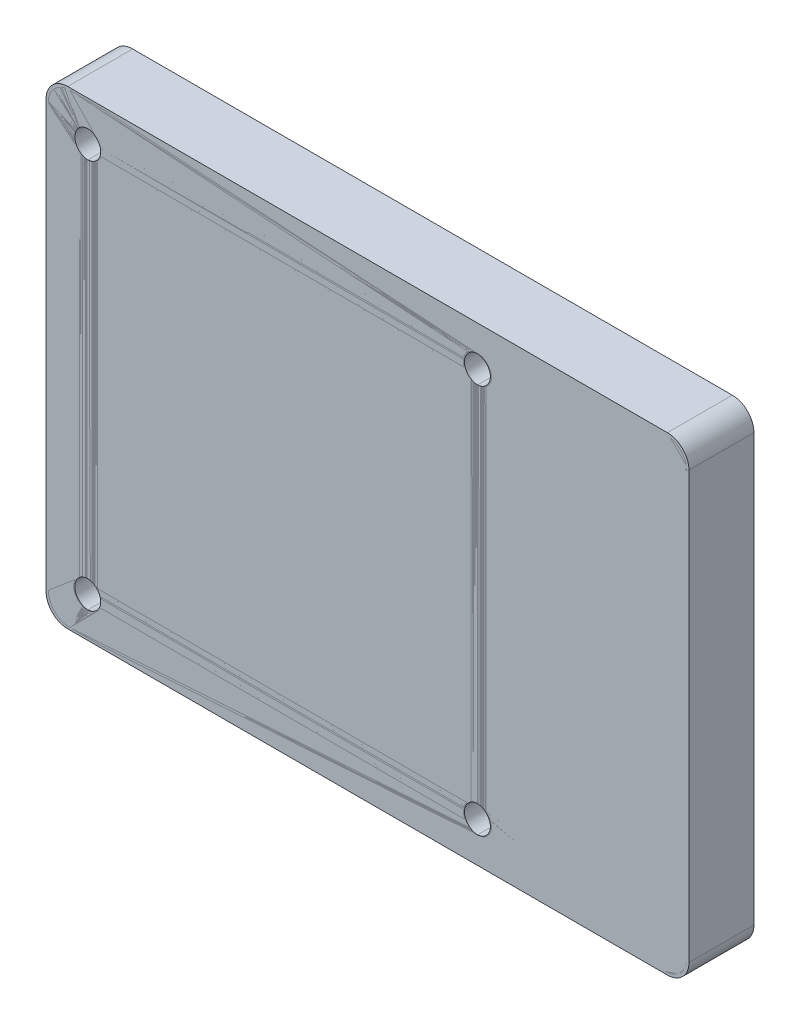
ISO-10303-21;
HEADER;
FILE_DESCRIPTION(('STEP AP214'),'2;1');
FILE_NAME('part.step','',(''),(''),'','','');
FILE_SCHEMA(('AUTOMOTIVE_DESIGN { 1 0 10303 214 1 1 1 1 }'));
ENDSEC;
DATA;
#1=APPLICATION_CONTEXT('core data for automotive mechanical design processes');
#2=APPLICATION_PROTOCOL_DEFINITION('international standard','automotive_design',2000,#1);
#3=PRODUCT_CONTEXT('',#1,'mechanical');
#4=PRODUCT('Part','Part','',(#3));
#5=PRODUCT_RELATED_PRODUCT_CATEGORY('part','',(#4));
#6=PRODUCT_DEFINITION_FORMATION('','',#4);
#7=PRODUCT_DEFINITION_CONTEXT('part definition',#1,'design');
#8=PRODUCT_DEFINITION('design','',#6,#7);
#9=PRODUCT_DEFINITION_SHAPE('','',#8);
#10=(LENGTH_UNIT() NAMED_UNIT(*) SI_UNIT(.MILLI.,.METRE.));
#11=(NAMED_UNIT(*) PLANE_ANGLE_UNIT() SI_UNIT($,.RADIAN.));
#12=(NAMED_UNIT(*) SI_UNIT($,.STERADIAN.) SOLID_ANGLE_UNIT());
#13=UNCERTAINTY_MEASURE_WITH_UNIT(LENGTH_MEASURE(1.E-05),#10,'distance_accuracy_value','');
#14=(GEOMETRIC_REPRESENTATION_CONTEXT(3) GLOBAL_UNCERTAINTY_ASSIGNED_CONTEXT((#13)) GLOBAL_UNIT_ASSIGNED_CONTEXT((#10,
#11,#12)) REPRESENTATION_CONTEXT('',''));
#15=CARTESIAN_POINT('',(0.,0.,0.));
#16=DIRECTION('',(0.,0.,1.));
#17=DIRECTION('',(1.,0.,0.));
#18=AXIS2_PLACEMENT_3D('',#15,#16,#17);
#19=CARTESIAN_POINT('',(-25.8,-18.,-1.));
#20=DIRECTION('',(0.,0.,-1.));
#21=DIRECTION('',(1.,0.,0.));
#22=AXIS2_PLACEMENT_3D('',#19,#20,#21);
#23=CYLINDRICAL_SURFACE('',#22,1.25);
#24=CARTESIAN_POINT('',(-25.8,-18.,-4.2));
#25=DIRECTION('',(0.,0.,-1.));
#26=DIRECTION('',(-1.,0.,0.));
#27=AXIS2_PLACEMENT_3D('',#24,#25,#26);
#28=CIRCLE('',#27,1.25);
#29=CARTESIAN_POINT('',(-27.05,-18.,-4.2));
#30=VERTEX_POINT('',#29);
#31=EDGE_CURVE('P0_E244',#30,#30,#28,.F.);
#32=ORIENTED_EDGE('',*,*,#31,.F.);
#33=EDGE_LOOP('',(#32));
#34=FACE_BOUND('',#33,.T.);
#35=CARTESIAN_POINT('',(-25.8,-18.,0.));
#36=DIRECTION('',(0.,0.,-1.));
#37=DIRECTION('',(-1.,0.,0.));
#38=AXIS2_PLACEMENT_3D('',#35,#36,#37);
#39=CIRCLE('',#38,1.25);
#40=CARTESIAN_POINT('',(-27.05,-18.,0.));
#41=VERTEX_POINT('',#40);
#42=EDGE_CURVE('P0_E354',#41,#41,#39,.F.);
#43=ORIENTED_EDGE('',*,*,#42,.T.);
#44=EDGE_LOOP('',(#43));
#45=FACE_BOUND('',#44,.T.);
#46=ADVANCED_FACE('P0_F17',(#34,#45),#23,.F.);
#47=CARTESIAN_POINT('',(-25.8,18.,-1.));
#48=DIRECTION('',(0.,0.,-1.));
#49=DIRECTION('',(1.,0.,0.));
#50=AXIS2_PLACEMENT_3D('',#47,#48,#49);
#51=CYLINDRICAL_SURFACE('',#50,1.25);
#52=CARTESIAN_POINT('',(-25.8,18.,-4.2));
#53=DIRECTION('',(0.,0.,-1.));
#54=DIRECTION('',(-1.,0.,0.));
#55=AXIS2_PLACEMENT_3D('',#52,#53,#54);
#56=CIRCLE('',#55,1.25);
#57=CARTESIAN_POINT('',(-27.05,18.,-4.2));
#58=VERTEX_POINT('',#57);
#59=EDGE_CURVE('P0_E283',#58,#58,#56,.F.);
#60=ORIENTED_EDGE('',*,*,#59,.F.);
#61=EDGE_LOOP('',(#60));
#62=FACE_BOUND('',#61,.T.);
#63=CARTESIAN_POINT('',(-25.8,18.,0.));
#64=DIRECTION('',(0.,0.,-1.));
#65=DIRECTION('',(-1.,0.,0.));
#66=AXIS2_PLACEMENT_3D('',#63,#64,#65);
#67=CIRCLE('',#66,1.25);
#68=CARTESIAN_POINT('',(-27.05,18.,0.));
#69=VERTEX_POINT('',#68);
#70=EDGE_CURVE('P0_E350',#69,#69,#67,.F.);
#71=ORIENTED_EDGE('',*,*,#70,.T.);
#72=EDGE_LOOP('',(#71));
#73=FACE_BOUND('',#72,.T.);
#74=ADVANCED_FACE('P0_F857',(#62,#73),#51,.F.);
#75=CARTESIAN_POINT('',(10.2,18.,-1.));
#76=DIRECTION('',(0.,0.,-1.));
#77=DIRECTION('',(1.,0.,0.));
#78=AXIS2_PLACEMENT_3D('',#75,#76,#77);
#79=CYLINDRICAL_SURFACE('',#78,1.25);
#80=CARTESIAN_POINT('',(10.2,18.,-4.2));
#81=DIRECTION('',(0.,0.,-1.));
#82=DIRECTION('',(-1.,0.,0.));
#83=AXIS2_PLACEMENT_3D('',#80,#81,#82);
#84=CIRCLE('',#83,1.25);
#85=CARTESIAN_POINT('',(8.95,18.,-4.2));
#86=VERTEX_POINT('',#85);
#87=EDGE_CURVE('P0_E290',#86,#86,#84,.F.);
#88=ORIENTED_EDGE('',*,*,#87,.F.);
#89=EDGE_LOOP('',(#88));
#90=FACE_BOUND('',#89,.T.);
#91=CARTESIAN_POINT('',(10.2,18.,0.));
#92=DIRECTION('',(0.,0.,-1.));
#93=DIRECTION('',(-1.,0.,0.));
#94=AXIS2_PLACEMENT_3D('',#91,#92,#93);
#95=CIRCLE('',#94,1.25);
#96=CARTESIAN_POINT('',(8.95,18.,0.));
#97=VERTEX_POINT('',#96);
#98=EDGE_CURVE('P0_E346',#97,#97,#95,.F.);
#99=ORIENTED_EDGE('',*,*,#98,.T.);
#100=EDGE_LOOP('',(#99));
#101=FACE_BOUND('',#100,.T.);
#102=ADVANCED_FACE('P0_F851',(#90,#101),#79,.F.);
#103=CARTESIAN_POINT('',(27.7,19.7,-13.8216));
#104=DIRECTION('',(0.,0.,1.));
#105=DIRECTION('',(1.,0.,0.));
#106=AXIS2_PLACEMENT_3D('',#103,#104,#105);
#107=CYLINDRICAL_SURFACE('',#106,2.);
#108=DIRECTION('',(0.,0.,-1.));
#109=VECTOR('',#108,1.);
#110=CARTESIAN_POINT('',(27.7,21.7,0.));
#111=LINE('',#110,#109);
#112=CARTESIAN_POINT('',(27.7,21.7,0.));
#113=VERTEX_POINT('',#112);
#114=CARTESIAN_POINT('',(27.7,21.7,-6.));
#115=VERTEX_POINT('',#114);
#116=EDGE_CURVE('P0_E294',#113,#115,#111,.T.);
#117=ORIENTED_EDGE('',*,*,#116,.F.);
#118=CARTESIAN_POINT('',(27.7,19.7,0.));
#119=DIRECTION('',(0.,0.,1.));
#120=DIRECTION('',(1.,0.,0.));
#121=AXIS2_PLACEMENT_3D('',#118,#119,#120);
#122=CIRCLE('',#121,2.);
#123=CARTESIAN_POINT('',(29.7,19.7,0.));
#124=VERTEX_POINT('',#123);
#125=EDGE_CURVE('P0_E230',#113,#124,#122,.F.);
#126=ORIENTED_EDGE('',*,*,#125,.T.);
#127=DIRECTION('',(0.,0.,1.));
#128=VECTOR('',#127,1.);
#129=CARTESIAN_POINT('',(29.7,19.7,0.));
#130=LINE('',#129,#128);
#131=CARTESIAN_POINT('',(29.7,19.7,-6.));
#132=VERTEX_POINT('',#131);
#133=EDGE_CURVE('P0_E20',#132,#124,#130,.T.);
#134=ORIENTED_EDGE('',*,*,#133,.F.);
#135=CARTESIAN_POINT('',(27.7,19.7,-6.));
#136=DIRECTION('',(0.,0.,1.));
#137=DIRECTION('',(1.,0.,0.));
#138=AXIS2_PLACEMENT_3D('',#135,#136,#137);
#139=CIRCLE('',#138,2.);
#140=EDGE_CURVE('P0_E227',#115,#132,#139,.F.);
#141=ORIENTED_EDGE('',*,*,#140,.F.);
#142=EDGE_LOOP('',(#117,#126,#134,#141));
#143=FACE_BOUND('',#142,.T.);
#144=ADVANCED_FACE('P0_F225',(#143),#107,.T.);
#145=CARTESIAN_POINT('',(29.7,21.7,0.));
#146=DIRECTION('',(1.,0.,0.));
#147=DIRECTION('',(0.,1.,0.));
#148=AXIS2_PLACEMENT_3D('',#145,#146,#147);
#149=PLANE('',#148);
#150=DIRECTION('',(0.,-1.,0.));
#151=VECTOR('',#150,1.);
#152=CARTESIAN_POINT('',(29.7,0.,-6.));
#153=LINE('',#152,#151);
#154=CARTESIAN_POINT('',(29.7,-19.7,-6.));
#155=VERTEX_POINT('',#154);
#156=EDGE_CURVE('P0_E236',#132,#155,#153,.T.);
#157=ORIENTED_EDGE('',*,*,#156,.F.);
#158=ORIENTED_EDGE('',*,*,#133,.T.);
#159=DIRECTION('',(0.,1.,0.));
#160=VECTOR('',#159,1.);
#161=CARTESIAN_POINT('',(29.7,21.7,0.));
#162=LINE('',#161,#160);
#163=CARTESIAN_POINT('',(29.7,-19.7,0.));
#164=VERTEX_POINT('',#163);
#165=EDGE_CURVE('P0_E328',#124,#164,#162,.F.);
#166=ORIENTED_EDGE('',*,*,#165,.T.);
#167=DIRECTION('',(0.,0.,1.));
#168=VECTOR('',#167,1.);
#169=CARTESIAN_POINT('',(29.7,-19.7,-13.8216));
#170=LINE('',#169,#168);
#171=EDGE_CURVE('P0_E234',#155,#164,#170,.T.);
#172=ORIENTED_EDGE('',*,*,#171,.F.);
#173=EDGE_LOOP('',(#157,#158,#166,#172));
#174=FACE_BOUND('',#173,.T.);
#175=ADVANCED_FACE('P0_F237',(#174),#149,.T.);
#176=CARTESIAN_POINT('',(27.7,-19.7,-13.8216));
#177=DIRECTION('',(0.,0.,1.));
#178=DIRECTION('',(0.,-1.,0.));
#179=AXIS2_PLACEMENT_3D('',#176,#177,#178);
#180=CYLINDRICAL_SURFACE('',#179,2.);
#181=ORIENTED_EDGE('',*,*,#171,.T.);
#182=CARTESIAN_POINT('',(27.7,-19.7,0.));
#183=DIRECTION('',(0.,0.,1.));
#184=DIRECTION('',(1.,0.,0.));
#185=AXIS2_PLACEMENT_3D('',#182,#183,#184);
#186=CIRCLE('',#185,2.);
#187=CARTESIAN_POINT('',(27.7,-21.7,0.));
#188=VERTEX_POINT('',#187);
#189=EDGE_CURVE('P0_E322',#164,#188,#186,.F.);
#190=ORIENTED_EDGE('',*,*,#189,.T.);
#191=DIRECTION('',(0.,0.,-1.));
#192=VECTOR('',#191,1.);
#193=CARTESIAN_POINT('',(27.7,-21.7,0.));
#194=LINE('',#193,#192);
#195=CARTESIAN_POINT('',(27.7,-21.7,-6.));
#196=VERTEX_POINT('',#195);
#197=EDGE_CURVE('P0_E313',#196,#188,#194,.F.);
#198=ORIENTED_EDGE('',*,*,#197,.F.);
#199=CARTESIAN_POINT('',(27.7,-19.7,-6.));
#200=DIRECTION('',(0.,0.,1.));
#201=DIRECTION('',(1.,0.,0.));
#202=AXIS2_PLACEMENT_3D('',#199,#200,#201);
#203=CIRCLE('',#202,2.);
#204=EDGE_CURVE('P0_E243',#155,#196,#203,.F.);
#205=ORIENTED_EDGE('',*,*,#204,.F.);
#206=EDGE_LOOP('',(#181,#190,#198,#205));
#207=FACE_BOUND('',#206,.T.);
#208=ADVANCED_FACE('P0_F321',(#207),#180,.T.);
#209=CARTESIAN_POINT('',(29.7,-21.7,0.));
#210=DIRECTION('',(0.,-1.,0.));
#211=DIRECTION('',(0.,0.,-1.));
#212=AXIS2_PLACEMENT_3D('',#209,#210,#211);
#213=PLANE('',#212);
#214=DIRECTION('',(-1.,0.,0.));
#215=VECTOR('',#214,1.);
#216=CARTESIAN_POINT('',(0.,-21.7,-6.));
#217=LINE('',#216,#215);
#218=CARTESIAN_POINT('',(-27.7,-21.7,-6.));
#219=VERTEX_POINT('',#218);
#220=EDGE_CURVE('P0_E274',#196,#219,#217,.T.);
#221=ORIENTED_EDGE('',*,*,#220,.F.);
#222=ORIENTED_EDGE('',*,*,#197,.T.);
#223=DIRECTION('',(1.,0.,0.));
#224=VECTOR('',#223,1.);
#225=CARTESIAN_POINT('',(29.7,-21.7,0.));
#226=LINE('',#225,#224);
#227=CARTESIAN_POINT('',(-27.7,-21.7,0.));
#228=VERTEX_POINT('',#227);
#229=EDGE_CURVE('P0_E330',#188,#228,#226,.F.);
#230=ORIENTED_EDGE('',*,*,#229,.T.);
#231=DIRECTION('',(0.,0.,1.));
#232=VECTOR('',#231,1.);
#233=CARTESIAN_POINT('',(-27.7,-21.7,-13.8216));
#234=LINE('',#233,#232);
#235=EDGE_CURVE('P0_E309',#219,#228,#234,.T.);
#236=ORIENTED_EDGE('',*,*,#235,.F.);
#237=EDGE_LOOP('',(#221,#222,#230,#236));
#238=FACE_BOUND('',#237,.T.);
#239=ADVANCED_FACE('P0_F524',(#238),#213,.T.);
#240=CARTESIAN_POINT('',(-27.7,-19.7,-13.8216));
#241=DIRECTION('',(0.,0.,1.));
#242=DIRECTION('',(-1.,0.,0.));
#243=AXIS2_PLACEMENT_3D('',#240,#241,#242);
#244=CYLINDRICAL_SURFACE('',#243,2.);
#245=ORIENTED_EDGE('',*,*,#235,.T.);
#246=CARTESIAN_POINT('',(-27.7,-19.7,0.));
#247=DIRECTION('',(0.,0.,1.));
#248=DIRECTION('',(1.,0.,0.));
#249=AXIS2_PLACEMENT_3D('',#246,#247,#248);
#250=CIRCLE('',#249,2.);
#251=CARTESIAN_POINT('',(-29.7,-19.7,0.));
#252=VERTEX_POINT('',#251);
#253=EDGE_CURVE('P0_E338',#228,#252,#250,.F.);
#254=ORIENTED_EDGE('',*,*,#253,.T.);
#255=DIRECTION('',(0.,0.,1.));
#256=VECTOR('',#255,1.);
#257=CARTESIAN_POINT('',(-29.7,-19.7,0.));
#258=LINE('',#257,#256);
#259=CARTESIAN_POINT('',(-29.7,-19.7,-6.));
#260=VERTEX_POINT('',#259);
#261=EDGE_CURVE('P0_E305',#260,#252,#258,.T.);
#262=ORIENTED_EDGE('',*,*,#261,.F.);
#263=CARTESIAN_POINT('',(-27.7,-19.7,-6.));
#264=DIRECTION('',(0.,0.,1.));
#265=DIRECTION('',(1.,0.,0.));
#266=AXIS2_PLACEMENT_3D('',#263,#264,#265);
#267=CIRCLE('',#266,2.);
#268=EDGE_CURVE('P0_E270',#219,#260,#267,.F.);
#269=ORIENTED_EDGE('',*,*,#268,.F.);
#270=EDGE_LOOP('',(#245,#254,#262,#269));
#271=FACE_BOUND('',#270,.T.);
#272=ADVANCED_FACE('P0_F510',(#271),#244,.T.);
#273=CARTESIAN_POINT('',(-29.7,-21.7,0.));
#274=DIRECTION('',(-1.,0.,0.));
#275=DIRECTION('',(0.,0.,1.));
#276=AXIS2_PLACEMENT_3D('',#273,#274,#275);
#277=PLANE('',#276);
#278=DIRECTION('',(0.,-1.,0.));
#279=VECTOR('',#278,1.);
#280=CARTESIAN_POINT('',(-29.7,0.,-6.));
#281=LINE('',#280,#279);
#282=CARTESIAN_POINT('',(-29.7,19.7,-6.));
#283=VERTEX_POINT('',#282);
#284=EDGE_CURVE('P0_E266',#260,#283,#281,.F.);
#285=ORIENTED_EDGE('',*,*,#284,.F.);
#286=ORIENTED_EDGE('',*,*,#261,.T.);
#287=DIRECTION('',(0.,1.,0.));
#288=VECTOR('',#287,1.);
#289=CARTESIAN_POINT('',(-29.7,-21.7,0.));
#290=LINE('',#289,#288);
#291=CARTESIAN_POINT('',(-29.7,19.7,0.));
#292=VERTEX_POINT('',#291);
#293=EDGE_CURVE('P0_E502',#252,#292,#290,.T.);
#294=ORIENTED_EDGE('',*,*,#293,.T.);
#295=DIRECTION('',(0.,0.,1.));
#296=VECTOR('',#295,1.);
#297=CARTESIAN_POINT('',(-29.7,19.7,-13.8216));
#298=LINE('',#297,#296);
#299=EDGE_CURVE('P0_E301',#283,#292,#298,.T.);
#300=ORIENTED_EDGE('',*,*,#299,.F.);
#301=EDGE_LOOP('',(#285,#286,#294,#300));
#302=FACE_BOUND('',#301,.T.);
#303=ADVANCED_FACE('P0_F515',(#302),#277,.T.);
#304=CARTESIAN_POINT('',(-27.7,19.7,-13.8216));
#305=DIRECTION('',(0.,0.,1.));
#306=DIRECTION('',(0.,1.,0.));
#307=AXIS2_PLACEMENT_3D('',#304,#305,#306);
#308=CYLINDRICAL_SURFACE('',#307,2.);
#309=ORIENTED_EDGE('',*,*,#299,.T.);
#310=CARTESIAN_POINT('',(-27.7,19.7,0.));
#311=DIRECTION('',(0.,0.,1.));
#312=DIRECTION('',(1.,0.,0.));
#313=AXIS2_PLACEMENT_3D('',#310,#311,#312);
#314=CIRCLE('',#313,2.);
#315=CARTESIAN_POINT('',(-27.7,21.7,0.));
#316=VERTEX_POINT('',#315);
#317=EDGE_CURVE('P0_E499',#292,#316,#314,.F.);
#318=ORIENTED_EDGE('',*,*,#317,.T.);
#319=DIRECTION('',(0.,0.,-1.));
#320=VECTOR('',#319,1.);
#321=CARTESIAN_POINT('',(-27.7,21.7,0.));
#322=LINE('',#321,#320);
#323=CARTESIAN_POINT('',(-27.7,21.7,-6.));
#324=VERTEX_POINT('',#323);
#325=EDGE_CURVE('P0_E297',#324,#316,#322,.F.);
#326=ORIENTED_EDGE('',*,*,#325,.F.);
#327=CARTESIAN_POINT('',(-27.7,19.7,-6.));
#328=DIRECTION('',(0.,0.,1.));
#329=DIRECTION('',(1.,0.,0.));
#330=AXIS2_PLACEMENT_3D('',#327,#328,#329);
#331=CIRCLE('',#330,2.);
#332=EDGE_CURVE('P0_E260',#283,#324,#331,.F.);
#333=ORIENTED_EDGE('',*,*,#332,.F.);
#334=EDGE_LOOP('',(#309,#318,#326,#333));
#335=FACE_BOUND('',#334,.T.);
#336=ADVANCED_FACE('P0_F518',(#335),#308,.T.);
#337=CARTESIAN_POINT('',(-29.7,21.7,0.));
#338=DIRECTION('',(0.,1.,0.));
#339=DIRECTION('',(1.,0.,0.));
#340=AXIS2_PLACEMENT_3D('',#337,#338,#339);
#341=PLANE('',#340);
#342=DIRECTION('',(1.,0.,0.));
#343=VECTOR('',#342,1.);
#344=CARTESIAN_POINT('',(-29.7,21.7,0.));
#345=LINE('',#344,#343);
#346=EDGE_CURVE('P0_E495',#316,#113,#345,.T.);
#347=ORIENTED_EDGE('',*,*,#346,.T.);
#348=ORIENTED_EDGE('',*,*,#116,.T.);
#349=DIRECTION('',(-1.,0.,0.));
#350=VECTOR('',#349,1.);
#351=CARTESIAN_POINT('',(0.,21.7,-6.));
#352=LINE('',#351,#350);
#353=EDGE_CURVE('P0_E249',#324,#115,#352,.F.);
#354=ORIENTED_EDGE('',*,*,#353,.F.);
#355=ORIENTED_EDGE('',*,*,#325,.T.);
#356=EDGE_LOOP('',(#347,#348,#354,#355));
#357=FACE_BOUND('',#356,.T.);
#358=ADVANCED_FACE('P0_F521',(#357),#341,.T.);
#359=CARTESIAN_POINT('',(0.,0.,-4.2));
#360=DIRECTION('',(0.,0.,-1.));
#361=DIRECTION('',(0.,-1.,0.));
#362=AXIS2_PLACEMENT_3D('',#359,#360,#361);
#363=PLANE('',#362);
#364=ORIENTED_EDGE('',*,*,#87,.T.);
#365=EDGE_LOOP('',(#364));
#366=FACE_BOUND('',#365,.T.);
#367=CARTESIAN_POINT('',(10.2,18.,-4.2));
#368=DIRECTION('',(0.,0.,-1.));
#369=DIRECTION('',(-1.,0.,0.));
#370=AXIS2_PLACEMENT_3D('',#367,#368,#369);
#371=CIRCLE('',#370,2.);
#372=CARTESIAN_POINT('',(8.24040820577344,18.4,-4.2));
#373=VERTEX_POINT('',#372);
#374=CARTESIAN_POINT('',(12.1595917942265,18.4,-4.2));
#375=VERTEX_POINT('',#374);
#376=EDGE_CURVE('P0_E466',#373,#375,#371,.F.);
#377=ORIENTED_EDGE('',*,*,#376,.F.);
#378=CARTESIAN_POINT('',(6.77071436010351,18.7,-4.2));
#379=DIRECTION('',(0.,0.,-1.));
#380=DIRECTION('',(-1.,0.,0.));
#381=AXIS2_PLACEMENT_3D('',#378,#379,#380);
#382=CIRCLE('',#381,1.5);
#383=CARTESIAN_POINT('',(6.77071436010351,20.2,-4.2));
#384=VERTEX_POINT('',#383);
#385=EDGE_CURVE('P0_E459',#373,#384,#382,.F.);
#386=ORIENTED_EDGE('',*,*,#385,.T.);
#387=DIRECTION('',(1.,0.,0.));
#388=VECTOR('',#387,1.);
#389=CARTESIAN_POINT('',(28.2,20.2,-4.2));
#390=LINE('',#389,#388);
#391=CARTESIAN_POINT('',(13.6292856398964,20.2,-4.2));
#392=VERTEX_POINT('',#391);
#393=EDGE_CURVE('P0_E443',#392,#384,#390,.F.);
#394=ORIENTED_EDGE('',*,*,#393,.F.);
#395=CARTESIAN_POINT('',(13.6292856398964,18.7,-4.2));
#396=DIRECTION('',(0.,0.,-1.));
#397=DIRECTION('',(-1.,0.,0.));
#398=AXIS2_PLACEMENT_3D('',#395,#396,#397);
#399=CIRCLE('',#398,1.5);
#400=EDGE_CURVE('P0_E473',#392,#375,#399,.F.);
#401=ORIENTED_EDGE('',*,*,#400,.T.);
#402=EDGE_LOOP('',(#377,#386,#394,#401));
#403=FACE_BOUND('',#402,.T.);
#404=ADVANCED_FACE('P0_F637',(#366,#403),#363,.T.);
#405=CARTESIAN_POINT('',(-27.2,19.2,7.8216));
#406=DIRECTION('',(0.,0.,-1.));
#407=DIRECTION('',(-1.,0.,0.));
#408=AXIS2_PLACEMENT_3D('',#405,#406,#407);
#409=CYLINDRICAL_SURFACE('',#408,1.);
#410=DIRECTION('',(0.,0.,-1.));
#411=VECTOR('',#410,1.);
#412=CARTESIAN_POINT('',(-27.2,20.2,0.));
#413=LINE('',#412,#411);
#414=CARTESIAN_POINT('',(-27.2,20.2,-4.2));
#415=VERTEX_POINT('',#414);
#416=CARTESIAN_POINT('',(-27.2,20.2,-6.));
#417=VERTEX_POINT('',#416);
#418=EDGE_CURVE('P0_E431',#415,#417,#413,.T.);
#419=ORIENTED_EDGE('',*,*,#418,.F.);
#420=CARTESIAN_POINT('',(-27.2,19.2,-4.2));
#421=DIRECTION('',(0.,0.,-1.));
#422=DIRECTION('',(-1.,0.,0.));
#423=AXIS2_PLACEMENT_3D('',#420,#421,#422);
#424=CIRCLE('',#423,1.);
#425=CARTESIAN_POINT('',(-28.2,19.2,-4.2));
#426=VERTEX_POINT('',#425);
#427=EDGE_CURVE('P0_E287',#426,#415,#424,.T.);
#428=ORIENTED_EDGE('',*,*,#427,.F.);
#429=DIRECTION('',(0.,0.,1.));
#430=VECTOR('',#429,1.);
#431=CARTESIAN_POINT('',(-28.2,19.2,0.));
#432=LINE('',#431,#430);
#433=CARTESIAN_POINT('',(-28.2,19.2,-6.));
#434=VERTEX_POINT('',#433);
#435=EDGE_CURVE('P0_E402',#434,#426,#432,.T.);
#436=ORIENTED_EDGE('',*,*,#435,.F.);
#437=CARTESIAN_POINT('',(-27.2,19.2,-6.));
#438=DIRECTION('',(0.,0.,-1.));
#439=DIRECTION('',(-1.,0.,0.));
#440=AXIS2_PLACEMENT_3D('',#437,#438,#439);
#441=CIRCLE('',#440,1.);
#442=EDGE_CURVE('P0_E251',#417,#434,#441,.F.);
#443=ORIENTED_EDGE('',*,*,#442,.F.);
#444=EDGE_LOOP('',(#419,#428,#436,#443));
#445=FACE_BOUND('',#444,.T.);
#446=ADVANCED_FACE('P0_F633',(#445),#409,.F.);
#447=CARTESIAN_POINT('',(0.,0.,-4.2));
#448=DIRECTION('',(0.,0.,-1.));
#449=DIRECTION('',(0.,-1.,0.));
#450=AXIS2_PLACEMENT_3D('',#447,#448,#449);
#451=PLANE('',#450);
#452=ORIENTED_EDGE('',*,*,#59,.T.);
#453=EDGE_LOOP('',(#452));
#454=FACE_BOUND('',#453,.T.);
#455=DIRECTION('',(0.,1.,0.));
#456=VECTOR('',#455,1.);
#457=CARTESIAN_POINT('',(-28.2,20.2,-4.2));
#458=LINE('',#457,#456);
#459=CARTESIAN_POINT('',(-28.2,14.6176930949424,-4.2));
#460=VERTEX_POINT('',#459);
#461=EDGE_CURVE('P0_E395',#426,#460,#458,.F.);
#462=ORIENTED_EDGE('',*,*,#461,.F.);
#463=ORIENTED_EDGE('',*,*,#427,.T.);
#464=DIRECTION('',(1.,0.,0.));
#465=VECTOR('',#464,1.);
#466=CARTESIAN_POINT('',(28.2,20.2,-4.2));
#467=LINE('',#466,#465);
#468=CARTESIAN_POINT('',(-22.3707143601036,20.2,-4.2));
#469=VERTEX_POINT('',#468);
#470=EDGE_CURVE('P0_E435',#469,#415,#467,.F.);
#471=ORIENTED_EDGE('',*,*,#470,.F.);
#472=CARTESIAN_POINT('',(-22.3707143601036,18.7,-4.2));
#473=DIRECTION('',(0.,0.,-1.));
#474=DIRECTION('',(-1.,0.,0.));
#475=AXIS2_PLACEMENT_3D('',#472,#473,#474);
#476=CIRCLE('',#475,1.5);
#477=CARTESIAN_POINT('',(-23.8404082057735,18.4,-4.2));
#478=VERTEX_POINT('',#477);
#479=EDGE_CURVE('P0_E423',#469,#478,#476,.F.);
#480=ORIENTED_EDGE('',*,*,#479,.T.);
#481=CARTESIAN_POINT('',(-25.8,18.,-4.2));
#482=DIRECTION('',(0.,0.,-1.));
#483=DIRECTION('',(-1.,0.,0.));
#484=AXIS2_PLACEMENT_3D('',#481,#482,#483);
#485=CIRCLE('',#484,2.);
#486=CARTESIAN_POINT('',(-26.3142857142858,16.06725319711,-4.2));
#487=VERTEX_POINT('',#486);
#488=EDGE_CURVE('P0_E416',#487,#478,#485,.F.);
#489=ORIENTED_EDGE('',*,*,#488,.F.);
#490=CARTESIAN_POINT('',(-26.7,14.6176930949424,-4.2));
#491=DIRECTION('',(0.,0.,-1.));
#492=DIRECTION('',(-1.,0.,0.));
#493=AXIS2_PLACEMENT_3D('',#490,#491,#492);
#494=CIRCLE('',#493,1.5);
#495=EDGE_CURVE('P0_E409',#487,#460,#494,.F.);
#496=ORIENTED_EDGE('',*,*,#495,.T.);
#497=EDGE_LOOP('',(#462,#463,#471,#480,#489,#496));
#498=FACE_BOUND('',#497,.T.);
#499=ADVANCED_FACE('P0_F629',(#454,#498),#451,.T.);
#500=CARTESIAN_POINT('',(0.,0.,-4.2));
#501=DIRECTION('',(0.,0.,-1.));
#502=DIRECTION('',(0.,-1.,0.));
#503=AXIS2_PLACEMENT_3D('',#500,#501,#502);
#504=PLANE('',#503);
#505=ORIENTED_EDGE('',*,*,#31,.T.);
#506=EDGE_LOOP('',(#505));
#507=FACE_BOUND('',#506,.T.);
#508=DIRECTION('',(1.,0.,0.));
#509=VECTOR('',#508,1.);
#510=CARTESIAN_POINT('',(-28.2,-20.2,-4.2));
#511=LINE('',#510,#509);
#512=CARTESIAN_POINT('',(-27.2,-20.2,-4.2));
#513=VERTEX_POINT('',#512);
#514=CARTESIAN_POINT('',(-22.3707143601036,-20.2,-4.2));
#515=VERTEX_POINT('',#514);
#516=EDGE_CURVE('P0_E372',#513,#515,#511,.T.);
#517=ORIENTED_EDGE('',*,*,#516,.F.);
#518=CARTESIAN_POINT('',(-27.2,-19.2,-4.2));
#519=DIRECTION('',(0.,0.,-1.));
#520=DIRECTION('',(-1.,0.,0.));
#521=AXIS2_PLACEMENT_3D('',#518,#519,#520);
#522=CIRCLE('',#521,1.);
#523=CARTESIAN_POINT('',(-28.2,-19.2,-4.2));
#524=VERTEX_POINT('',#523);
#525=EDGE_CURVE('P0_E258',#513,#524,#522,.T.);
#526=ORIENTED_EDGE('',*,*,#525,.T.);
#527=DIRECTION('',(0.,1.,0.));
#528=VECTOR('',#527,1.);
#529=CARTESIAN_POINT('',(-28.2,20.2,-4.2));
#530=LINE('',#529,#528);
#531=CARTESIAN_POINT('',(-28.2,-14.6176930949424,-4.2));
#532=VERTEX_POINT('',#531);
#533=EDGE_CURVE('P0_E369',#532,#524,#530,.F.);
#534=ORIENTED_EDGE('',*,*,#533,.F.);
#535=CARTESIAN_POINT('',(-26.7,-14.6176930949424,-4.2));
#536=DIRECTION('',(0.,0.,-1.));
#537=DIRECTION('',(-1.,0.,0.));
#538=AXIS2_PLACEMENT_3D('',#535,#536,#537);
#539=CIRCLE('',#538,1.5);
#540=CARTESIAN_POINT('',(-26.3142857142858,-16.06725319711,-4.2));
#541=VERTEX_POINT('',#540);
#542=EDGE_CURVE('P0_E1680',#532,#541,#539,.F.);
#543=ORIENTED_EDGE('',*,*,#542,.T.);
#544=CARTESIAN_POINT('',(-25.8,-18.,-4.2));
#545=DIRECTION('',(0.,0.,-1.));
#546=DIRECTION('',(-1.,0.,0.));
#547=AXIS2_PLACEMENT_3D('',#544,#545,#546);
#548=CIRCLE('',#547,2.);
#549=CARTESIAN_POINT('',(-23.8404082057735,-18.4,-4.2));
#550=VERTEX_POINT('',#549);
#551=EDGE_CURVE('P0_E1004',#550,#541,#548,.F.);
#552=ORIENTED_EDGE('',*,*,#551,.F.);
#553=CARTESIAN_POINT('',(-22.3707143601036,-18.7,-4.2));
#554=DIRECTION('',(0.,0.,-1.));
#555=DIRECTION('',(-1.,0.,0.));
#556=AXIS2_PLACEMENT_3D('',#553,#554,#555);
#557=CIRCLE('',#556,1.5);
#558=EDGE_CURVE('P0_E1723',#550,#515,#557,.F.);
#559=ORIENTED_EDGE('',*,*,#558,.T.);
#560=EDGE_LOOP('',(#517,#526,#534,#543,#552,#559));
#561=FACE_BOUND('',#560,.T.);
#562=ADVANCED_FACE('P0_F366',(#507,#561),#504,.T.);
#563=CARTESIAN_POINT('',(0.,0.,-6.));
#564=DIRECTION('',(0.,0.,-1.));
#565=DIRECTION('',(0.,-1.,0.));
#566=AXIS2_PLACEMENT_3D('',#563,#564,#565);
#567=PLANE('',#566);
#568=CARTESIAN_POINT('',(27.2,-19.2,-6.));
#569=DIRECTION('',(0.,0.,-1.));
#570=DIRECTION('',(-1.,0.,0.));
#571=AXIS2_PLACEMENT_3D('',#568,#569,#570);
#572=CIRCLE('',#571,1.);
#573=CARTESIAN_POINT('',(27.2,-20.2,-6.));
#574=VERTEX_POINT('',#573);
#575=CARTESIAN_POINT('',(28.2,-19.2,-6.));
#576=VERTEX_POINT('',#575);
#577=EDGE_CURVE('P0_E492',#574,#576,#572,.F.);
#578=ORIENTED_EDGE('',*,*,#577,.T.);
#579=DIRECTION('',(0.,1.,0.));
#580=VECTOR('',#579,1.);
#581=CARTESIAN_POINT('',(28.2,-20.2,-6.));
#582=LINE('',#581,#580);
#583=CARTESIAN_POINT('',(28.2,19.2,-6.));
#584=VERTEX_POINT('',#583);
#585=EDGE_CURVE('P0_E488',#584,#576,#582,.F.);
#586=ORIENTED_EDGE('',*,*,#585,.F.);
#587=CARTESIAN_POINT('',(27.2,19.2,-6.));
#588=DIRECTION('',(0.,0.,-1.));
#589=DIRECTION('',(-1.,0.,0.));
#590=AXIS2_PLACEMENT_3D('',#587,#588,#589);
#591=CIRCLE('',#590,1.);
#592=CARTESIAN_POINT('',(27.2,20.2,-6.));
#593=VERTEX_POINT('',#592);
#594=EDGE_CURVE('P0_E477',#584,#593,#591,.F.);
#595=ORIENTED_EDGE('',*,*,#594,.T.);
#596=DIRECTION('',(1.,0.,0.));
#597=VECTOR('',#596,1.);
#598=CARTESIAN_POINT('',(28.2,20.2,-6.));
#599=LINE('',#598,#597);
#600=EDGE_CURVE('P0_E455',#417,#593,#599,.T.);
#601=ORIENTED_EDGE('',*,*,#600,.F.);
#602=ORIENTED_EDGE('',*,*,#442,.T.);
#603=DIRECTION('',(0.,1.,0.));
#604=VECTOR('',#603,1.);
#605=CARTESIAN_POINT('',(-28.2,20.2,-6.));
#606=LINE('',#605,#604);
#607=CARTESIAN_POINT('',(-28.2,-19.2,-6.));
#608=VERTEX_POINT('',#607);
#609=EDGE_CURVE('P0_E406',#608,#434,#606,.T.);
#610=ORIENTED_EDGE('',*,*,#609,.F.);
#611=CARTESIAN_POINT('',(-27.2,-19.2,-6.));
#612=DIRECTION('',(0.,0.,-1.));
#613=DIRECTION('',(-1.,0.,0.));
#614=AXIS2_PLACEMENT_3D('',#611,#612,#613);
#615=CIRCLE('',#614,1.);
#616=CARTESIAN_POINT('',(-27.2,-20.2,-6.));
#617=VERTEX_POINT('',#616);
#618=EDGE_CURVE('P0_E358',#608,#617,#615,.F.);
#619=ORIENTED_EDGE('',*,*,#618,.T.);
#620=DIRECTION('',(1.,0.,0.));
#621=VECTOR('',#620,1.);
#622=CARTESIAN_POINT('',(-28.2,-20.2,-6.));
#623=LINE('',#622,#621);
#624=EDGE_CURVE('P0_E1787',#574,#617,#623,.F.);
#625=ORIENTED_EDGE('',*,*,#624,.F.);
#626=EDGE_LOOP('',(#578,#586,#595,#601,#602,#610,#619,#625));
#627=FACE_BOUND('',#626,.T.);
#628=ORIENTED_EDGE('',*,*,#353,.T.);
#629=ORIENTED_EDGE('',*,*,#140,.T.);
#630=ORIENTED_EDGE('',*,*,#156,.T.);
#631=ORIENTED_EDGE('',*,*,#204,.T.);
#632=ORIENTED_EDGE('',*,*,#220,.T.);
#633=ORIENTED_EDGE('',*,*,#268,.T.);
#634=ORIENTED_EDGE('',*,*,#284,.T.);
#635=ORIENTED_EDGE('',*,*,#332,.T.);
#636=EDGE_LOOP('',(#628,#629,#630,#631,#632,#633,#634,#635));
#637=FACE_BOUND('',#636,.T.);
#638=ADVANCED_FACE('P0_F246',(#627,#637),#567,.T.);
#639=CARTESIAN_POINT('',(-27.2,-19.2,7.8216));
#640=DIRECTION('',(0.,0.,-1.));
#641=DIRECTION('',(0.,-1.,0.));
#642=AXIS2_PLACEMENT_3D('',#639,#640,#641);
#643=CYLINDRICAL_SURFACE('',#642,1.);
#644=DIRECTION('',(0.,0.,1.));
#645=VECTOR('',#644,1.);
#646=CARTESIAN_POINT('',(-28.2,-19.2,0.));
#647=LINE('',#646,#645);
#648=EDGE_CURVE('P0_E378',#524,#608,#647,.F.);
#649=ORIENTED_EDGE('',*,*,#648,.F.);
#650=ORIENTED_EDGE('',*,*,#525,.F.);
#651=DIRECTION('',(0.,0.,-1.));
#652=VECTOR('',#651,1.);
#653=CARTESIAN_POINT('',(-27.2,-20.2,0.));
#654=LINE('',#653,#652);
#655=EDGE_CURVE('P0_E1797',#617,#513,#654,.F.);
#656=ORIENTED_EDGE('',*,*,#655,.F.);
#657=ORIENTED_EDGE('',*,*,#618,.F.);
#658=EDGE_LOOP('',(#649,#650,#656,#657));
#659=FACE_BOUND('',#658,.T.);
#660=ADVANCED_FACE('P0_F379',(#659),#643,.F.);
#661=CARTESIAN_POINT('',(0.,0.,0.));
#662=DIRECTION('',(0.,0.,-1.));
#663=DIRECTION('',(0.,-1.,0.));
#664=AXIS2_PLACEMENT_3D('',#661,#662,#663);
#665=PLANE('',#664);
#666=ORIENTED_EDGE('',*,*,#317,.F.);
#667=ORIENTED_EDGE('',*,*,#293,.F.);
#668=ORIENTED_EDGE('',*,*,#253,.F.);
#669=ORIENTED_EDGE('',*,*,#229,.F.);
#670=ORIENTED_EDGE('',*,*,#189,.F.);
#671=ORIENTED_EDGE('',*,*,#165,.F.);
#672=ORIENTED_EDGE('',*,*,#125,.F.);
#673=ORIENTED_EDGE('',*,*,#346,.F.);
#674=EDGE_LOOP('',(#666,#667,#668,#669,#670,#671,#672,#673));
#675=FACE_BOUND('',#674,.T.);
#676=ORIENTED_EDGE('',*,*,#98,.F.);
#677=EDGE_LOOP('',(#676));
#678=FACE_BOUND('',#677,.T.);
#679=CARTESIAN_POINT('',(10.2,-18.,0.));
#680=DIRECTION('',(0.,0.,-1.));
#681=DIRECTION('',(-1.,0.,0.));
#682=AXIS2_PLACEMENT_3D('',#679,#680,#681);
#683=CIRCLE('',#682,1.25);
#684=CARTESIAN_POINT('',(8.95,-18.,0.));
#685=VERTEX_POINT('',#684);
#686=EDGE_CURVE('P0_E992',#685,#685,#683,.T.);
#687=ORIENTED_EDGE('',*,*,#686,.T.);
#688=EDGE_LOOP('',(#687));
#689=FACE_BOUND('',#688,.T.);
#690=ORIENTED_EDGE('',*,*,#70,.F.);
#691=EDGE_LOOP('',(#690));
#692=FACE_BOUND('',#691,.T.);
#693=ORIENTED_EDGE('',*,*,#42,.F.);
#694=EDGE_LOOP('',(#693));
#695=FACE_BOUND('',#694,.T.);
#696=ADVANCED_FACE('P0_F326',(#675,#678,#689,#692,#695),#665,.F.);
#697=CARTESIAN_POINT('',(27.2,-19.2,7.8216));
#698=DIRECTION('',(0.,0.,-1.));
#699=DIRECTION('',(1.,0.,0.));
#700=AXIS2_PLACEMENT_3D('',#697,#698,#699);
#701=CYLINDRICAL_SURFACE('',#700,1.);
#702=DIRECTION('',(0.,0.,-1.));
#703=VECTOR('',#702,1.);
#704=CARTESIAN_POINT('',(27.2,-20.2,0.));
#705=LINE('',#704,#703);
#706=CARTESIAN_POINT('',(27.2,-20.2,-1.));
#707=VERTEX_POINT('',#706);
#708=EDGE_CURVE('P0_E1776',#707,#574,#705,.T.);
#709=ORIENTED_EDGE('',*,*,#708,.F.);
#710=CARTESIAN_POINT('',(27.2,-19.2,-1.));
#711=DIRECTION('',(0.,0.,-1.));
#712=DIRECTION('',(-1.,0.,0.));
#713=AXIS2_PLACEMENT_3D('',#710,#711,#712);
#714=CIRCLE('',#713,1.);
#715=CARTESIAN_POINT('',(28.2,-19.2,-1.));
#716=VERTEX_POINT('',#715);
#717=EDGE_CURVE('P0_E1854',#707,#716,#714,.F.);
#718=ORIENTED_EDGE('',*,*,#717,.T.);
#719=DIRECTION('',(0.,0.,1.));
#720=VECTOR('',#719,1.);
#721=CARTESIAN_POINT('',(28.2,-19.2,0.));
#722=LINE('',#721,#720);
#723=EDGE_CURVE('P0_E484',#576,#716,#722,.T.);
#724=ORIENTED_EDGE('',*,*,#723,.F.);
#725=ORIENTED_EDGE('',*,*,#577,.F.);
#726=EDGE_LOOP('',(#709,#718,#724,#725));
#727=FACE_BOUND('',#726,.T.);
#728=ADVANCED_FACE('P0_F615',(#727),#701,.F.);
#729=CARTESIAN_POINT('',(28.2,-20.2,0.));
#730=DIRECTION('',(-1.,0.,0.));
#731=DIRECTION('',(0.,0.,1.));
#732=AXIS2_PLACEMENT_3D('',#729,#730,#731);
#733=PLANE('',#732);
#734=ORIENTED_EDGE('',*,*,#585,.T.);
#735=ORIENTED_EDGE('',*,*,#723,.T.);
#736=DIRECTION('',(0.,1.,0.));
#737=VECTOR('',#736,1.);
#738=CARTESIAN_POINT('',(28.2,-20.2,-1.));
#739=LINE('',#738,#737);
#740=CARTESIAN_POINT('',(28.2,19.2,-1.));
#741=VERTEX_POINT('',#740);
#742=EDGE_CURVE('P0_E1862',#716,#741,#739,.T.);
#743=ORIENTED_EDGE('',*,*,#742,.T.);
#744=DIRECTION('',(0.,0.,1.));
#745=VECTOR('',#744,1.);
#746=CARTESIAN_POINT('',(28.2,19.2,0.));
#747=LINE('',#746,#745);
#748=EDGE_CURVE('P0_E480',#741,#584,#747,.F.);
#749=ORIENTED_EDGE('',*,*,#748,.T.);
#750=EDGE_LOOP('',(#734,#735,#743,#749));
#751=FACE_BOUND('',#750,.T.);
#752=ADVANCED_FACE('P0_F611',(#751),#733,.T.);
#753=CARTESIAN_POINT('',(27.2,19.2,7.8216));
#754=DIRECTION('',(0.,0.,-1.));
#755=DIRECTION('',(0.,1.,0.));
#756=AXIS2_PLACEMENT_3D('',#753,#754,#755);
#757=CYLINDRICAL_SURFACE('',#756,1.);
#758=ORIENTED_EDGE('',*,*,#748,.F.);
#759=CARTESIAN_POINT('',(27.2,19.2,-1.));
#760=DIRECTION('',(0.,0.,-1.));
#761=DIRECTION('',(-1.,0.,0.));
#762=AXIS2_PLACEMENT_3D('',#759,#760,#761);
#763=CIRCLE('',#762,1.);
#764=CARTESIAN_POINT('',(27.2,20.2,-1.));
#765=VERTEX_POINT('',#764);
#766=EDGE_CURVE('P0_E1871',#741,#765,#763,.F.);
#767=ORIENTED_EDGE('',*,*,#766,.T.);
#768=DIRECTION('',(0.,0.,-1.));
#769=VECTOR('',#768,1.);
#770=CARTESIAN_POINT('',(27.2,20.2,0.));
#771=LINE('',#770,#769);
#772=EDGE_CURVE('P0_E451',#593,#765,#771,.F.);
#773=ORIENTED_EDGE('',*,*,#772,.F.);
#774=ORIENTED_EDGE('',*,*,#594,.F.);
#775=EDGE_LOOP('',(#758,#767,#773,#774));
#776=FACE_BOUND('',#775,.T.);
#777=ADVANCED_FACE('P0_F607',(#776),#757,.F.);
#778=CARTESIAN_POINT('',(13.6292856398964,18.7,-1.));
#779=DIRECTION('',(0.,0.,-1.));
#780=DIRECTION('',(1.,0.,0.));
#781=AXIS2_PLACEMENT_3D('',#778,#779,#780);
#782=CYLINDRICAL_SURFACE('',#781,1.5);
#783=DIRECTION('',(0.,0.,-1.));
#784=VECTOR('',#783,1.);
#785=CARTESIAN_POINT('',(12.1595917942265,18.4,-1.));
#786=LINE('',#785,#784);
#787=CARTESIAN_POINT('',(12.1595917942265,18.4,-1.));
#788=VERTEX_POINT('',#787);
#789=EDGE_CURVE('P0_E469',#375,#788,#786,.F.);
#790=ORIENTED_EDGE('',*,*,#789,.F.);
#791=ORIENTED_EDGE('',*,*,#400,.F.);
#792=DIRECTION('',(0.,0.,-1.));
#793=VECTOR('',#792,1.);
#794=CARTESIAN_POINT('',(13.6292856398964,20.2,0.));
#795=LINE('',#794,#793);
#796=CARTESIAN_POINT('',(13.6292856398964,20.2,-1.));
#797=VERTEX_POINT('',#796);
#798=EDGE_CURVE('P0_E447',#797,#392,#795,.T.);
#799=ORIENTED_EDGE('',*,*,#798,.F.);
#800=CARTESIAN_POINT('',(13.6292856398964,18.7,-1.));
#801=DIRECTION('',(0.,0.,-1.));
#802=DIRECTION('',(-1.,0.,0.));
#803=AXIS2_PLACEMENT_3D('',#800,#801,#802);
#804=CIRCLE('',#803,1.5);
#805=EDGE_CURVE('P0_E981',#797,#788,#804,.F.);
#806=ORIENTED_EDGE('',*,*,#805,.T.);
#807=EDGE_LOOP('',(#790,#791,#799,#806));
#808=FACE_BOUND('',#807,.T.);
#809=ADVANCED_FACE('P0_F603',(#808),#782,.F.);
#810=CARTESIAN_POINT('',(10.2,18.,-1.));
#811=DIRECTION('',(0.,0.,-1.));
#812=DIRECTION('',(1.,0.,0.));
#813=AXIS2_PLACEMENT_3D('',#810,#811,#812);
#814=CYLINDRICAL_SURFACE('',#813,2.);
#815=DIRECTION('',(0.,0.,-1.));
#816=VECTOR('',#815,1.);
#817=CARTESIAN_POINT('',(8.24040820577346,18.4,-1.));
#818=LINE('',#817,#816);
#819=CARTESIAN_POINT('',(8.24040820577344,18.4,-1.));
#820=VERTEX_POINT('',#819);
#821=EDGE_CURVE('P0_E462',#820,#373,#818,.T.);
#822=ORIENTED_EDGE('',*,*,#821,.T.);
#823=ORIENTED_EDGE('',*,*,#376,.T.);
#824=ORIENTED_EDGE('',*,*,#789,.T.);
#825=CARTESIAN_POINT('',(10.2,18.,-1.));
#826=DIRECTION('',(0.,0.,-1.));
#827=DIRECTION('',(-1.,0.,0.));
#828=AXIS2_PLACEMENT_3D('',#825,#826,#827);
#829=CIRCLE('',#828,2.);
#830=EDGE_CURVE('P0_E970',#788,#820,#829,.T.);
#831=ORIENTED_EDGE('',*,*,#830,.T.);
#832=EDGE_LOOP('',(#822,#823,#824,#831));
#833=FACE_BOUND('',#832,.T.);
#834=ADVANCED_FACE('P0_F599',(#833),#814,.T.);
#835=CARTESIAN_POINT('',(6.77071436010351,18.7,-1.));
#836=DIRECTION('',(0.,0.,-1.));
#837=DIRECTION('',(1.,0.,0.));
#838=AXIS2_PLACEMENT_3D('',#835,#836,#837);
#839=CYLINDRICAL_SURFACE('',#838,1.5);
#840=CARTESIAN_POINT('',(6.77071436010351,18.7,-1.));
#841=DIRECTION('',(0.,0.,-1.));
#842=DIRECTION('',(-1.,0.,0.));
#843=AXIS2_PLACEMENT_3D('',#840,#841,#842);
#844=CIRCLE('',#843,1.5);
#845=CARTESIAN_POINT('',(6.77071436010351,20.2,-1.));
#846=VERTEX_POINT('',#845);
#847=EDGE_CURVE('P0_E965',#820,#846,#844,.F.);
#848=ORIENTED_EDGE('',*,*,#847,.T.);
#849=DIRECTION('',(0.,0.,-1.));
#850=VECTOR('',#849,1.);
#851=CARTESIAN_POINT('',(6.7707143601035,20.2,0.));
#852=LINE('',#851,#850);
#853=EDGE_CURVE('P0_E439',#384,#846,#852,.F.);
#854=ORIENTED_EDGE('',*,*,#853,.F.);
#855=ORIENTED_EDGE('',*,*,#385,.F.);
#856=ORIENTED_EDGE('',*,*,#821,.F.);
#857=EDGE_LOOP('',(#848,#854,#855,#856));
#858=FACE_BOUND('',#857,.T.);
#859=ADVANCED_FACE('P0_F595',(#858),#839,.F.);
#860=CARTESIAN_POINT('',(28.2,20.2,0.));
#861=DIRECTION('',(0.,-1.,0.));
#862=DIRECTION('',(0.,0.,-1.));
#863=AXIS2_PLACEMENT_3D('',#860,#861,#862);
#864=PLANE('',#863);
#865=ORIENTED_EDGE('',*,*,#470,.T.);
#866=ORIENTED_EDGE('',*,*,#418,.T.);
#867=ORIENTED_EDGE('',*,*,#600,.T.);
#868=ORIENTED_EDGE('',*,*,#772,.T.);
#869=DIRECTION('',(1.,0.,0.));
#870=VECTOR('',#869,1.);
#871=CARTESIAN_POINT('',(28.2,20.2,-1.));
#872=LINE('',#871,#870);
#873=EDGE_CURVE('P0_E1880',#765,#797,#872,.F.);
#874=ORIENTED_EDGE('',*,*,#873,.T.);
#875=ORIENTED_EDGE('',*,*,#798,.T.);
#876=ORIENTED_EDGE('',*,*,#393,.T.);
#877=ORIENTED_EDGE('',*,*,#853,.T.);
#878=DIRECTION('',(1.,0.,0.));
#879=VECTOR('',#878,1.);
#880=CARTESIAN_POINT('',(28.2,20.2,-1.));
#881=LINE('',#880,#879);
#882=CARTESIAN_POINT('',(-22.3707143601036,20.2,-1.));
#883=VERTEX_POINT('',#882);
#884=EDGE_CURVE('P0_E969',#846,#883,#881,.F.);
#885=ORIENTED_EDGE('',*,*,#884,.T.);
#886=DIRECTION('',(0.,0.,-1.));
#887=VECTOR('',#886,1.);
#888=CARTESIAN_POINT('',(-22.3707143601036,20.2,0.));
#889=LINE('',#888,#887);
#890=EDGE_CURVE('P0_E427',#883,#469,#889,.T.);
#891=ORIENTED_EDGE('',*,*,#890,.T.);
#892=EDGE_LOOP('',(#865,#866,#867,#868,#874,#875,#876,#877,#885,#891));
#893=FACE_BOUND('',#892,.T.);
#894=ADVANCED_FACE('P0_F591',(#893),#864,.T.);
#895=CARTESIAN_POINT('',(-22.3707143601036,18.7,-1.));
#896=DIRECTION('',(0.,0.,-1.));
#897=DIRECTION('',(1.,0.,0.));
#898=AXIS2_PLACEMENT_3D('',#895,#896,#897);
#899=CYLINDRICAL_SURFACE('',#898,1.5);
#900=DIRECTION('',(0.,0.,-1.));
#901=VECTOR('',#900,1.);
#902=CARTESIAN_POINT('',(-23.8404082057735,18.4,-1.));
#903=LINE('',#902,#901);
#904=CARTESIAN_POINT('',(-23.8404082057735,18.4,-1.));
#905=VERTEX_POINT('',#904);
#906=EDGE_CURVE('P0_E419',#478,#905,#903,.F.);
#907=ORIENTED_EDGE('',*,*,#906,.F.);
#908=ORIENTED_EDGE('',*,*,#479,.F.);
#909=ORIENTED_EDGE('',*,*,#890,.F.);
#910=CARTESIAN_POINT('',(-22.3707143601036,18.7,-1.));
#911=DIRECTION('',(0.,0.,-1.));
#912=DIRECTION('',(-1.,0.,0.));
#913=AXIS2_PLACEMENT_3D('',#910,#911,#912);
#914=CIRCLE('',#913,1.5);
#915=EDGE_CURVE('P0_E959',#883,#905,#914,.F.);
#916=ORIENTED_EDGE('',*,*,#915,.T.);
#917=EDGE_LOOP('',(#907,#908,#909,#916));
#918=FACE_BOUND('',#917,.T.);
#919=ADVANCED_FACE('P0_F587',(#918),#899,.F.);
#920=CARTESIAN_POINT('',(-25.8,18.,-1.));
#921=DIRECTION('',(0.,0.,-1.));
#922=DIRECTION('',(1.,0.,0.));
#923=AXIS2_PLACEMENT_3D('',#920,#921,#922);
#924=CYLINDRICAL_SURFACE('',#923,2.);
#925=DIRECTION('',(0.,0.,-1.));
#926=VECTOR('',#925,1.);
#927=CARTESIAN_POINT('',(-26.3142857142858,16.06725319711,-1.));
#928=LINE('',#927,#926);
#929=CARTESIAN_POINT('',(-26.3142857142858,16.06725319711,-1.));
#930=VERTEX_POINT('',#929);
#931=EDGE_CURVE('P0_E412',#930,#487,#928,.T.);
#932=ORIENTED_EDGE('',*,*,#931,.T.);
#933=ORIENTED_EDGE('',*,*,#488,.T.);
#934=ORIENTED_EDGE('',*,*,#906,.T.);
#935=CARTESIAN_POINT('',(-25.8,18.,-1.));
#936=DIRECTION('',(0.,0.,-1.));
#937=DIRECTION('',(-1.,0.,0.));
#938=AXIS2_PLACEMENT_3D('',#935,#936,#937);
#939=CIRCLE('',#938,2.);
#940=EDGE_CURVE('P0_E954',#905,#930,#939,.T.);
#941=ORIENTED_EDGE('',*,*,#940,.T.);
#942=EDGE_LOOP('',(#932,#933,#934,#941));
#943=FACE_BOUND('',#942,.T.);
#944=ADVANCED_FACE('P0_F583',(#943),#924,.T.);
#945=CARTESIAN_POINT('',(-26.7,14.6176930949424,-1.));
#946=DIRECTION('',(0.,0.,-1.));
#947=DIRECTION('',(1.,0.,0.));
#948=AXIS2_PLACEMENT_3D('',#945,#946,#947);
#949=CYLINDRICAL_SURFACE('',#948,1.5);
#950=ORIENTED_EDGE('',*,*,#931,.F.);
#951=CARTESIAN_POINT('',(-26.7,14.6176930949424,-1.));
#952=DIRECTION('',(0.,0.,-1.));
#953=DIRECTION('',(-1.,0.,0.));
#954=AXIS2_PLACEMENT_3D('',#951,#952,#953);
#955=CIRCLE('',#954,1.5);
#956=CARTESIAN_POINT('',(-28.2,14.6176930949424,-1.));
#957=VERTEX_POINT('',#956);
#958=EDGE_CURVE('P0_E958',#930,#957,#955,.F.);
#959=ORIENTED_EDGE('',*,*,#958,.T.);
#960=DIRECTION('',(0.,0.,1.));
#961=VECTOR('',#960,1.);
#962=CARTESIAN_POINT('',(-28.2,14.6176930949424,0.));
#963=LINE('',#962,#961);
#964=EDGE_CURVE('P0_E389',#460,#957,#963,.T.);
#965=ORIENTED_EDGE('',*,*,#964,.F.);
#966=ORIENTED_EDGE('',*,*,#495,.F.);
#967=EDGE_LOOP('',(#950,#959,#965,#966));
#968=FACE_BOUND('',#967,.T.);
#969=ADVANCED_FACE('P0_F580',(#968),#949,.F.);
#970=CARTESIAN_POINT('',(-28.2,20.2,0.));
#971=DIRECTION('',(1.,0.,0.));
#972=DIRECTION('',(0.,1.,0.));
#973=AXIS2_PLACEMENT_3D('',#970,#971,#972);
#974=PLANE('',#973);
#975=ORIENTED_EDGE('',*,*,#533,.T.);
#976=ORIENTED_EDGE('',*,*,#648,.T.);
#977=ORIENTED_EDGE('',*,*,#609,.T.);
#978=ORIENTED_EDGE('',*,*,#435,.T.);
#979=ORIENTED_EDGE('',*,*,#461,.T.);
#980=ORIENTED_EDGE('',*,*,#964,.T.);
#981=DIRECTION('',(0.,1.,0.));
#982=VECTOR('',#981,1.);
#983=CARTESIAN_POINT('',(-28.2,20.2,-1.));
#984=LINE('',#983,#982);
#985=CARTESIAN_POINT('',(-28.2,-14.6176930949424,-1.));
#986=VERTEX_POINT('',#985);
#987=EDGE_CURVE('P0_E1945',#957,#986,#984,.F.);
#988=ORIENTED_EDGE('',*,*,#987,.T.);
#989=DIRECTION('',(0.,0.,1.));
#990=VECTOR('',#989,1.);
#991=CARTESIAN_POINT('',(-28.2,-14.6176930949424,0.));
#992=LINE('',#991,#990);
#993=EDGE_CURVE('P0_E383',#986,#532,#992,.F.);
#994=ORIENTED_EDGE('',*,*,#993,.T.);
#995=EDGE_LOOP('',(#975,#976,#977,#978,#979,#980,#988,#994));
#996=FACE_BOUND('',#995,.T.);
#997=ADVANCED_FACE('P0_F385',(#996),#974,.T.);
#998=CARTESIAN_POINT('',(-26.7,-14.6176930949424,-1.));
#999=DIRECTION('',(0.,0.,-1.));
#1000=DIRECTION('',(1.,0.,0.));
#1001=AXIS2_PLACEMENT_3D('',#998,#999,#1000);
#1002=CYLINDRICAL_SURFACE('',#1001,1.5);
#1003=DIRECTION('',(0.,0.,-1.));
#1004=VECTOR('',#1003,1.);
#1005=CARTESIAN_POINT('',(-26.3142857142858,-16.06725319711,-1.));
#1006=LINE('',#1005,#1004);
#1007=CARTESIAN_POINT('',(-26.3142857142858,-16.06725319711,-1.));
#1008=VERTEX_POINT('',#1007);
#1009=EDGE_CURVE('P0_E1009',#541,#1008,#1006,.F.);
#1010=ORIENTED_EDGE('',*,*,#1009,.F.);
#1011=ORIENTED_EDGE('',*,*,#542,.F.);
#1012=ORIENTED_EDGE('',*,*,#993,.F.);
#1013=CARTESIAN_POINT('',(-26.7,-14.6176930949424,-1.));
#1014=DIRECTION('',(0.,0.,-1.));
#1015=DIRECTION('',(-1.,0.,0.));
#1016=AXIS2_PLACEMENT_3D('',#1013,#1014,#1015);
#1017=CIRCLE('',#1016,1.5);
#1018=EDGE_CURVE('P0_E948',#986,#1008,#1017,.F.);
#1019=ORIENTED_EDGE('',*,*,#1018,.T.);
#1020=EDGE_LOOP('',(#1010,#1011,#1012,#1019));
#1021=FACE_BOUND('',#1020,.T.);
#1022=ADVANCED_FACE('P0_F573',(#1021),#1002,.F.);
#1023=CARTESIAN_POINT('',(-25.8,-18.,-1.));
#1024=DIRECTION('',(0.,0.,-1.));
#1025=DIRECTION('',(1.,0.,0.));
#1026=AXIS2_PLACEMENT_3D('',#1023,#1024,#1025);
#1027=CYLINDRICAL_SURFACE('',#1026,2.);
#1028=DIRECTION('',(0.,0.,-1.));
#1029=VECTOR('',#1028,1.);
#1030=CARTESIAN_POINT('',(-23.8404082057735,-18.4,-1.));
#1031=LINE('',#1030,#1029);
#1032=CARTESIAN_POINT('',(-23.8404082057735,-18.4,-1.));
#1033=VERTEX_POINT('',#1032);
#1034=EDGE_CURVE('P0_E1008',#1033,#550,#1031,.T.);
#1035=ORIENTED_EDGE('',*,*,#1034,.T.);
#1036=ORIENTED_EDGE('',*,*,#551,.T.);
#1037=ORIENTED_EDGE('',*,*,#1009,.T.);
#1038=CARTESIAN_POINT('',(-25.8,-18.,-1.));
#1039=DIRECTION('',(0.,0.,-1.));
#1040=DIRECTION('',(-1.,0.,0.));
#1041=AXIS2_PLACEMENT_3D('',#1038,#1039,#1040);
#1042=CIRCLE('',#1041,2.);
#1043=EDGE_CURVE('P0_E943',#1008,#1033,#1042,.T.);
#1044=ORIENTED_EDGE('',*,*,#1043,.T.);
#1045=EDGE_LOOP('',(#1035,#1036,#1037,#1044));
#1046=FACE_BOUND('',#1045,.T.);
#1047=ADVANCED_FACE('P0_F569',(#1046),#1027,.T.);
#1048=CARTESIAN_POINT('',(-22.3707143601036,-18.7,-1.));
#1049=DIRECTION('',(0.,0.,-1.));
#1050=DIRECTION('',(1.,0.,0.));
#1051=AXIS2_PLACEMENT_3D('',#1048,#1049,#1050);
#1052=CYLINDRICAL_SURFACE('',#1051,1.5);
#1053=ORIENTED_EDGE('',*,*,#1034,.F.);
#1054=CARTESIAN_POINT('',(-22.3707143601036,-18.7,-1.));
#1055=DIRECTION('',(0.,0.,-1.));
#1056=DIRECTION('',(-1.,0.,0.));
#1057=AXIS2_PLACEMENT_3D('',#1054,#1055,#1056);
#1058=CIRCLE('',#1057,1.5);
#1059=CARTESIAN_POINT('',(-22.3707143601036,-20.2,-1.));
#1060=VERTEX_POINT('',#1059);
#1061=EDGE_CURVE('P0_E947',#1033,#1060,#1058,.F.);
#1062=ORIENTED_EDGE('',*,*,#1061,.T.);
#1063=DIRECTION('',(0.,0.,-1.));
#1064=VECTOR('',#1063,1.);
#1065=CARTESIAN_POINT('',(-22.3707143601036,-20.2,0.));
#1066=LINE('',#1065,#1064);
#1067=EDGE_CURVE('P0_E1745',#515,#1060,#1066,.F.);
#1068=ORIENTED_EDGE('',*,*,#1067,.F.);
#1069=ORIENTED_EDGE('',*,*,#558,.F.);
#1070=EDGE_LOOP('',(#1053,#1062,#1068,#1069));
#1071=FACE_BOUND('',#1070,.T.);
#1072=ADVANCED_FACE('P0_F565',(#1071),#1052,.F.);
#1073=CARTESIAN_POINT('',(-28.2,-20.2,0.));
#1074=DIRECTION('',(0.,1.,0.));
#1075=DIRECTION('',(1.,0.,0.));
#1076=AXIS2_PLACEMENT_3D('',#1073,#1074,#1075);
#1077=PLANE('',#1076);
#1078=ORIENTED_EDGE('',*,*,#624,.T.);
#1079=ORIENTED_EDGE('',*,*,#655,.T.);
#1080=ORIENTED_EDGE('',*,*,#516,.T.);
#1081=ORIENTED_EDGE('',*,*,#1067,.T.);
#1082=DIRECTION('',(1.,0.,0.));
#1083=VECTOR('',#1082,1.);
#1084=CARTESIAN_POINT('',(-28.2,-20.2,-1.));
#1085=LINE('',#1084,#1083);
#1086=CARTESIAN_POINT('',(6.7707143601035,-20.2,-1.));
#1087=VERTEX_POINT('',#1086);
#1088=EDGE_CURVE('P0_E1978',#1060,#1087,#1085,.T.);
#1089=ORIENTED_EDGE('',*,*,#1088,.T.);
#1090=DIRECTION('',(0.,0.,-1.));
#1091=VECTOR('',#1090,1.);
#1092=CARTESIAN_POINT('',(6.7707143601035,-20.2,0.));
#1093=LINE('',#1092,#1091);
#1094=CARTESIAN_POINT('',(6.7707143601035,-20.2,-4.2));
#1095=VERTEX_POINT('',#1094);
#1096=EDGE_CURVE('P0_E997',#1087,#1095,#1093,.T.);
#1097=ORIENTED_EDGE('',*,*,#1096,.T.);
#1098=DIRECTION('',(1.,0.,0.));
#1099=VECTOR('',#1098,1.);
#1100=CARTESIAN_POINT('',(-28.2,-20.2,-4.2));
#1101=LINE('',#1100,#1099);
#1102=CARTESIAN_POINT('',(13.6292856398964,-20.2,-4.2));
#1103=VERTEX_POINT('',#1102);
#1104=EDGE_CURVE('P0_E1755',#1095,#1103,#1101,.T.);
#1105=ORIENTED_EDGE('',*,*,#1104,.T.);
#1106=DIRECTION('',(0.,0.,-1.));
#1107=VECTOR('',#1106,1.);
#1108=CARTESIAN_POINT('',(13.6292856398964,-20.2,0.));
#1109=LINE('',#1108,#1107);
#1110=CARTESIAN_POINT('',(13.6292856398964,-20.2,-1.));
#1111=VERTEX_POINT('',#1110);
#1112=EDGE_CURVE('P0_E1806',#1103,#1111,#1109,.F.);
#1113=ORIENTED_EDGE('',*,*,#1112,.T.);
#1114=DIRECTION('',(1.,0.,0.));
#1115=VECTOR('',#1114,1.);
#1116=CARTESIAN_POINT('',(-28.2,-20.2,-1.));
#1117=LINE('',#1116,#1115);
#1118=EDGE_CURVE('P0_E1765',#1111,#707,#1117,.T.);
#1119=ORIENTED_EDGE('',*,*,#1118,.T.);
#1120=ORIENTED_EDGE('',*,*,#708,.T.);
#1121=EDGE_LOOP('',(#1078,#1079,#1080,#1081,#1089,#1097,#1105,#1113,#1119,#1120));
#1122=FACE_BOUND('',#1121,.T.);
#1123=ADVANCED_FACE('P0_F561',(#1122),#1077,.T.);
#1124=CARTESIAN_POINT('',(13.6292856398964,-18.7,-1.));
#1125=DIRECTION('',(0.,0.,-1.));
#1126=DIRECTION('',(1.,0.,0.));
#1127=AXIS2_PLACEMENT_3D('',#1124,#1125,#1126);
#1128=CYLINDRICAL_SURFACE('',#1127,1.5);
#1129=DIRECTION('',(0.,0.,-1.));
#1130=VECTOR('',#1129,1.);
#1131=CARTESIAN_POINT('',(12.1595917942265,-18.4,-1.));
#1132=LINE('',#1131,#1130);
#1133=CARTESIAN_POINT('',(12.1595917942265,-18.4,-1.));
#1134=VERTEX_POINT('',#1133);
#1135=CARTESIAN_POINT('',(12.1595917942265,-18.4,-4.2));
#1136=VERTEX_POINT('',#1135);
#1137=EDGE_CURVE('P0_E998',#1134,#1136,#1132,.T.);
#1138=ORIENTED_EDGE('',*,*,#1137,.F.);
#1139=CARTESIAN_POINT('',(13.6292856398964,-18.7,-1.));
#1140=DIRECTION('',(0.,0.,-1.));
#1141=DIRECTION('',(-1.,0.,0.));
#1142=AXIS2_PLACEMENT_3D('',#1139,#1140,#1141);
#1143=CIRCLE('',#1142,1.5);
#1144=EDGE_CURVE('P0_E1988',#1134,#1111,#1143,.F.);
#1145=ORIENTED_EDGE('',*,*,#1144,.T.);
#1146=ORIENTED_EDGE('',*,*,#1112,.F.);
#1147=CARTESIAN_POINT('',(13.6292856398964,-18.7,-4.2));
#1148=DIRECTION('',(0.,0.,-1.));
#1149=DIRECTION('',(-1.,0.,0.));
#1150=AXIS2_PLACEMENT_3D('',#1147,#1148,#1149);
#1151=CIRCLE('',#1150,1.5);
#1152=EDGE_CURVE('P0_E929',#1136,#1103,#1151,.F.);
#1153=ORIENTED_EDGE('',*,*,#1152,.F.);
#1154=EDGE_LOOP('',(#1138,#1145,#1146,#1153));
#1155=FACE_BOUND('',#1154,.T.);
#1156=ADVANCED_FACE('P0_F557',(#1155),#1128,.F.);
#1157=CARTESIAN_POINT('',(10.2,-18.,-1.));
#1158=DIRECTION('',(0.,0.,-1.));
#1159=DIRECTION('',(1.,0.,0.));
#1160=AXIS2_PLACEMENT_3D('',#1157,#1158,#1159);
#1161=CYLINDRICAL_SURFACE('',#1160,1.25);
#1162=CARTESIAN_POINT('',(10.2,-18.,-4.2));
#1163=DIRECTION('',(0.,0.,-1.));
#1164=DIRECTION('',(-1.,0.,0.));
#1165=AXIS2_PLACEMENT_3D('',#1162,#1163,#1164);
#1166=CIRCLE('',#1165,1.25);
#1167=CARTESIAN_POINT('',(8.95,-18.,-4.2));
#1168=VERTEX_POINT('',#1167);
#1169=EDGE_CURVE('P0_E919',#1168,#1168,#1166,.F.);
#1170=ORIENTED_EDGE('',*,*,#1169,.F.);
#1171=EDGE_LOOP('',(#1170));
#1172=FACE_BOUND('',#1171,.T.);
#1173=ORIENTED_EDGE('',*,*,#686,.F.);
#1174=EDGE_LOOP('',(#1173));
#1175=FACE_BOUND('',#1174,.T.);
#1176=ADVANCED_FACE('P0_F553',(#1172,#1175),#1161,.F.);
#1177=CARTESIAN_POINT('',(0.,0.,-1.));
#1178=DIRECTION('',(0.,0.,1.));
#1179=DIRECTION('',(1.,0.,0.));
#1180=AXIS2_PLACEMENT_3D('',#1177,#1178,#1179);
#1181=PLANE('',#1180);
#1182=ORIENTED_EDGE('',*,*,#1144,.F.);
#1183=CARTESIAN_POINT('',(10.2,-18.,-1.));
#1184=DIRECTION('',(0.,0.,-1.));
#1185=DIRECTION('',(-1.,0.,0.));
#1186=AXIS2_PLACEMENT_3D('',#1183,#1184,#1185);
#1187=CIRCLE('',#1186,2.);
#1188=CARTESIAN_POINT('',(8.24040820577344,-18.4,-1.));
#1189=VERTEX_POINT('',#1188);
#1190=EDGE_CURVE('P0_E890',#1189,#1134,#1187,.T.);
#1191=ORIENTED_EDGE('',*,*,#1190,.F.);
#1192=CARTESIAN_POINT('',(6.77071436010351,-18.7,-1.));
#1193=DIRECTION('',(0.,0.,-1.));
#1194=DIRECTION('',(-1.,0.,0.));
#1195=AXIS2_PLACEMENT_3D('',#1192,#1193,#1194);
#1196=CIRCLE('',#1195,1.5);
#1197=EDGE_CURVE('P0_E901',#1189,#1087,#1196,.T.);
#1198=ORIENTED_EDGE('',*,*,#1197,.T.);
#1199=ORIENTED_EDGE('',*,*,#1088,.F.);
#1200=ORIENTED_EDGE('',*,*,#1061,.F.);
#1201=ORIENTED_EDGE('',*,*,#1043,.F.);
#1202=ORIENTED_EDGE('',*,*,#1018,.F.);
#1203=ORIENTED_EDGE('',*,*,#987,.F.);
#1204=ORIENTED_EDGE('',*,*,#958,.F.);
#1205=ORIENTED_EDGE('',*,*,#940,.F.);
#1206=ORIENTED_EDGE('',*,*,#915,.F.);
#1207=ORIENTED_EDGE('',*,*,#884,.F.);
#1208=ORIENTED_EDGE('',*,*,#847,.F.);
#1209=ORIENTED_EDGE('',*,*,#830,.F.);
#1210=ORIENTED_EDGE('',*,*,#805,.F.);
#1211=ORIENTED_EDGE('',*,*,#873,.F.);
#1212=ORIENTED_EDGE('',*,*,#766,.F.);
#1213=ORIENTED_EDGE('',*,*,#742,.F.);
#1214=ORIENTED_EDGE('',*,*,#717,.F.);
#1215=ORIENTED_EDGE('',*,*,#1118,.F.);
#1216=EDGE_LOOP('',(#1182,#1191,#1198,#1199,#1200,#1201,#1202,#1203,#1204,#1205,#1206,#1207,
#1208,#1209,#1210,#1211,#1212,#1213,#1214,#1215));
#1217=FACE_BOUND('',#1216,.T.);
#1218=ADVANCED_FACE('P0_F549',(#1217),#1181,.F.);
#1219=CARTESIAN_POINT('',(0.,0.,-4.2));
#1220=DIRECTION('',(0.,0.,-1.));
#1221=DIRECTION('',(0.,-1.,0.));
#1222=AXIS2_PLACEMENT_3D('',#1219,#1220,#1221);
#1223=PLANE('',#1222);
#1224=ORIENTED_EDGE('',*,*,#1169,.T.);
#1225=EDGE_LOOP('',(#1224));
#1226=FACE_BOUND('',#1225,.T.);
#1227=CARTESIAN_POINT('',(10.2,-18.,-4.2));
#1228=DIRECTION('',(0.,0.,-1.));
#1229=DIRECTION('',(-1.,0.,0.));
#1230=AXIS2_PLACEMENT_3D('',#1227,#1228,#1229);
#1231=CIRCLE('',#1230,2.);
#1232=CARTESIAN_POINT('',(8.24040820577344,-18.4,-4.2));
#1233=VERTEX_POINT('',#1232);
#1234=EDGE_CURVE('P0_E27',#1136,#1233,#1231,.F.);
#1235=ORIENTED_EDGE('',*,*,#1234,.F.);
#1236=ORIENTED_EDGE('',*,*,#1152,.T.);
#1237=ORIENTED_EDGE('',*,*,#1104,.F.);
#1238=CARTESIAN_POINT('',(6.77071436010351,-18.7,-4.2));
#1239=DIRECTION('',(0.,0.,-1.));
#1240=DIRECTION('',(-1.,0.,0.));
#1241=AXIS2_PLACEMENT_3D('',#1238,#1239,#1240);
#1242=CIRCLE('',#1241,1.5);
#1243=EDGE_CURVE('P0_E36',#1095,#1233,#1242,.F.);
#1244=ORIENTED_EDGE('',*,*,#1243,.T.);
#1245=EDGE_LOOP('',(#1235,#1236,#1237,#1244));
#1246=FACE_BOUND('',#1245,.T.);
#1247=ADVANCED_FACE('P0_F542',(#1226,#1246),#1223,.T.);
#1248=CARTESIAN_POINT('',(6.77071436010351,-18.7,-1.));
#1249=DIRECTION('',(0.,0.,-1.));
#1250=DIRECTION('',(1.,0.,0.));
#1251=AXIS2_PLACEMENT_3D('',#1248,#1249,#1250);
#1252=CYLINDRICAL_SURFACE('',#1251,1.5);
#1253=ORIENTED_EDGE('',*,*,#1197,.F.);
#1254=DIRECTION('',(0.,0.,-1.));
#1255=VECTOR('',#1254,1.);
#1256=CARTESIAN_POINT('',(8.24040820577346,-18.4,-1.));
#1257=LINE('',#1256,#1255);
#1258=EDGE_CURVE('P0_E11',#1233,#1189,#1257,.F.);
#1259=ORIENTED_EDGE('',*,*,#1258,.F.);
#1260=ORIENTED_EDGE('',*,*,#1243,.F.);
#1261=ORIENTED_EDGE('',*,*,#1096,.F.);
#1262=EDGE_LOOP('',(#1253,#1259,#1260,#1261));
#1263=FACE_BOUND('',#1262,.T.);
#1264=ADVANCED_FACE('P0_F536',(#1263),#1252,.F.);
#1265=CARTESIAN_POINT('',(10.2,-18.,-1.));
#1266=DIRECTION('',(0.,0.,-1.));
#1267=DIRECTION('',(1.,0.,0.));
#1268=AXIS2_PLACEMENT_3D('',#1265,#1266,#1267);
#1269=CYLINDRICAL_SURFACE('',#1268,2.);
#1270=ORIENTED_EDGE('',*,*,#1234,.T.);
#1271=ORIENTED_EDGE('',*,*,#1258,.T.);
#1272=ORIENTED_EDGE('',*,*,#1190,.T.);
#1273=ORIENTED_EDGE('',*,*,#1137,.T.);
#1274=EDGE_LOOP('',(#1270,#1271,#1272,#1273));
#1275=FACE_BOUND('',#1274,.T.);
#1276=ADVANCED_FACE('P0_F534',(#1275),#1269,.T.);
#1277=CLOSED_SHELL('',(#46,#74,#102,#144,#175,#208,#239,#272,#303,#336,#358,#404,#446,#499,#562,
#638,#660,#696,#728,#752,#777,#809,#834,#859,#894,#919,#944,#969,#997,#1022,#1047,#1072,#1123,
#1156,#1176,#1218,#1247,#1264,#1276));
#1278=MANIFOLD_SOLID_BREP('P0_B1',#1277);
#1279=CARTESIAN_POINT('',(10.1,18.,-1.));
#1280=DIRECTION('',(0.,0.,-1.));
#1281=DIRECTION('',(0.,1.,0.));
#1282=AXIS2_PLACEMENT_3D('',#1279,#1280,#1281);
#1283=CYLINDRICAL_SURFACE('',#1282,1.25);
#1284=CARTESIAN_POINT('',(10.1,18.,0.));
#1285=DIRECTION('',(0.,0.,-1.));
#1286=DIRECTION('',(-1.,0.,0.));
#1287=AXIS2_PLACEMENT_3D('',#1284,#1285,#1286);
#1288=CIRCLE('',#1287,1.25);
#1289=CARTESIAN_POINT('',(8.85,18.,0.));
#1290=VERTEX_POINT('',#1289);
#1291=EDGE_CURVE('P1_E290',#1290,#1290,#1288,.F.);
#1292=ORIENTED_EDGE('',*,*,#1291,.T.);
#1293=EDGE_LOOP('',(#1292));
#1294=FACE_BOUND('',#1293,.T.);
#1295=CARTESIAN_POINT('',(10.1,18.,-4.2));
#1296=DIRECTION('',(0.,0.,-1.));
#1297=DIRECTION('',(-1.,0.,0.));
#1298=AXIS2_PLACEMENT_3D('',#1295,#1296,#1297);
#1299=CIRCLE('',#1298,1.25);
#1300=CARTESIAN_POINT('',(8.85,18.,-4.2));
#1301=VERTEX_POINT('',#1300);
#1302=EDGE_CURVE('P1_E304',#1301,#1301,#1299,.F.);
#1303=ORIENTED_EDGE('',*,*,#1302,.F.);
#1304=EDGE_LOOP('',(#1303));
#1305=FACE_BOUND('',#1304,.T.);
#1306=ADVANCED_FACE('P1_F17',(#1294,#1305),#1283,.F.);
#1307=CARTESIAN_POINT('',(-25.9,18.,-1.));
#1308=DIRECTION('',(0.,0.,-1.));
#1309=DIRECTION('',(0.,1.,0.));
#1310=AXIS2_PLACEMENT_3D('',#1307,#1308,#1309);
#1311=CYLINDRICAL_SURFACE('',#1310,1.25);
#1312=CARTESIAN_POINT('',(-25.9,18.,0.));
#1313=DIRECTION('',(0.,0.,-1.));
#1314=DIRECTION('',(-1.,0.,0.));
#1315=AXIS2_PLACEMENT_3D('',#1312,#1313,#1314);
#1316=CIRCLE('',#1315,1.25);
#1317=CARTESIAN_POINT('',(-27.15,18.,0.));
#1318=VERTEX_POINT('',#1317);
#1319=EDGE_CURVE('P1_E286',#1318,#1318,#1316,.F.);
#1320=ORIENTED_EDGE('',*,*,#1319,.T.);
#1321=EDGE_LOOP('',(#1320));
#1322=FACE_BOUND('',#1321,.T.);
#1323=CARTESIAN_POINT('',(-25.9,18.,-4.2));
#1324=DIRECTION('',(0.,0.,-1.));
#1325=DIRECTION('',(-1.,0.,0.));
#1326=AXIS2_PLACEMENT_3D('',#1323,#1324,#1325);
#1327=CIRCLE('',#1326,1.25);
#1328=CARTESIAN_POINT('',(-27.15,18.,-4.2));
#1329=VERTEX_POINT('',#1328);
#1330=EDGE_CURVE('P1_E300',#1329,#1329,#1327,.F.);
#1331=ORIENTED_EDGE('',*,*,#1330,.F.);
#1332=EDGE_LOOP('',(#1331));
#1333=FACE_BOUND('',#1332,.T.);
#1334=ADVANCED_FACE('P1_F802',(#1322,#1333),#1311,.F.);
#1335=CARTESIAN_POINT('',(-29.5,-21.5,0.));
#1336=DIRECTION('',(-1.,0.,0.));
#1337=DIRECTION('',(0.,0.,1.));
#1338=AXIS2_PLACEMENT_3D('',#1335,#1336,#1337);
#1339=PLANE('',#1338);
#1340=DIRECTION('',(0.,-1.,0.));
#1341=VECTOR('',#1340,1.);
#1342=CARTESIAN_POINT('',(-29.5,0.,-6.));
#1343=LINE('',#1342,#1341);
#1344=CARTESIAN_POINT('',(-29.5,-19.5,-6.));
#1345=VERTEX_POINT('',#1344);
#1346=CARTESIAN_POINT('',(-29.5,19.5,-6.));
#1347=VERTEX_POINT('',#1346);
#1348=EDGE_CURVE('P1_E227',#1345,#1347,#1343,.F.);
#1349=ORIENTED_EDGE('',*,*,#1348,.F.);
#1350=DIRECTION('',(0.,0.,1.));
#1351=VECTOR('',#1350,1.);
#1352=CARTESIAN_POINT('',(-29.5,-19.5,-13.8216));
#1353=LINE('',#1352,#1351);
#1354=CARTESIAN_POINT('',(-29.5,-19.5,0.));
#1355=VERTEX_POINT('',#1354);
#1356=EDGE_CURVE('P1_E311',#1355,#1345,#1353,.F.);
#1357=ORIENTED_EDGE('',*,*,#1356,.F.);
#1358=DIRECTION('',(0.,1.,0.));
#1359=VECTOR('',#1358,1.);
#1360=CARTESIAN_POINT('',(-29.5,-21.5,0.));
#1361=LINE('',#1360,#1359);
#1362=CARTESIAN_POINT('',(-29.5,19.5,0.));
#1363=VERTEX_POINT('',#1362);
#1364=EDGE_CURVE('P1_E230',#1355,#1363,#1361,.T.);
#1365=ORIENTED_EDGE('',*,*,#1364,.T.);
#1366=DIRECTION('',(0.,0.,1.));
#1367=VECTOR('',#1366,1.);
#1368=CARTESIAN_POINT('',(-29.5,19.5,-13.8216));
#1369=LINE('',#1368,#1367);
#1370=EDGE_CURVE('P1_E20',#1347,#1363,#1369,.T.);
#1371=ORIENTED_EDGE('',*,*,#1370,.F.);
#1372=EDGE_LOOP('',(#1349,#1357,#1365,#1371));
#1373=FACE_BOUND('',#1372,.T.);
#1374=ADVANCED_FACE('P1_F225',(#1373),#1339,.T.);
#1375=CARTESIAN_POINT('',(-27.5,19.5,-13.8216));
#1376=DIRECTION('',(0.,0.,1.));
#1377=DIRECTION('',(0.,1.,0.));
#1378=AXIS2_PLACEMENT_3D('',#1375,#1376,#1377);
#1379=CYLINDRICAL_SURFACE('',#1378,2.);
#1380=ORIENTED_EDGE('',*,*,#1370,.T.);
#1381=CARTESIAN_POINT('',(-27.5,19.5,0.));
#1382=DIRECTION('',(0.,0.,1.));
#1383=DIRECTION('',(1.,0.,0.));
#1384=AXIS2_PLACEMENT_3D('',#1381,#1382,#1383);
#1385=CIRCLE('',#1384,2.);
#1386=CARTESIAN_POINT('',(-27.5,21.5,0.));
#1387=VERTEX_POINT('',#1386);
#1388=EDGE_CURVE('P1_E273',#1363,#1387,#1385,.F.);
#1389=ORIENTED_EDGE('',*,*,#1388,.T.);
#1390=DIRECTION('',(0.,0.,-1.));
#1391=VECTOR('',#1390,1.);
#1392=CARTESIAN_POINT('',(-27.5,21.5,0.));
#1393=LINE('',#1392,#1391);
#1394=CARTESIAN_POINT('',(-27.5,21.5,-6.));
#1395=VERTEX_POINT('',#1394);
#1396=EDGE_CURVE('P1_E234',#1395,#1387,#1393,.F.);
#1397=ORIENTED_EDGE('',*,*,#1396,.F.);
#1398=CARTESIAN_POINT('',(-27.5,19.5,-6.));
#1399=DIRECTION('',(0.,0.,1.));
#1400=DIRECTION('',(1.,0.,0.));
#1401=AXIS2_PLACEMENT_3D('',#1398,#1399,#1400);
#1402=CIRCLE('',#1401,2.);
#1403=EDGE_CURVE('P1_E236',#1347,#1395,#1402,.F.);
#1404=ORIENTED_EDGE('',*,*,#1403,.F.);
#1405=EDGE_LOOP('',(#1380,#1389,#1397,#1404));
#1406=FACE_BOUND('',#1405,.T.);
#1407=ADVANCED_FACE('P1_F237',(#1406),#1379,.T.);
#1408=CARTESIAN_POINT('',(-29.5,21.5,0.));
#1409=DIRECTION('',(0.,1.,0.));
#1410=DIRECTION('',(1.,0.,0.));
#1411=AXIS2_PLACEMENT_3D('',#1408,#1409,#1410);
#1412=PLANE('',#1411);
#1413=DIRECTION('',(-1.,0.,0.));
#1414=VECTOR('',#1413,1.);
#1415=CARTESIAN_POINT('',(0.,21.5,-6.));
#1416=LINE('',#1415,#1414);
#1417=CARTESIAN_POINT('',(27.5,21.5,-6.));
#1418=VERTEX_POINT('',#1417);
#1419=EDGE_CURVE('P1_E243',#1395,#1418,#1416,.F.);
#1420=ORIENTED_EDGE('',*,*,#1419,.F.);
#1421=ORIENTED_EDGE('',*,*,#1396,.T.);
#1422=DIRECTION('',(1.,0.,0.));
#1423=VECTOR('',#1422,1.);
#1424=CARTESIAN_POINT('',(-29.5,21.5,0.));
#1425=LINE('',#1424,#1423);
#1426=CARTESIAN_POINT('',(27.5,21.5,0.));
#1427=VERTEX_POINT('',#1426);
#1428=EDGE_CURVE('P1_E270',#1387,#1427,#1425,.T.);
#1429=ORIENTED_EDGE('',*,*,#1428,.T.);
#1430=DIRECTION('',(0.,0.,1.));
#1431=VECTOR('',#1430,1.);
#1432=CARTESIAN_POINT('',(27.5,21.5,-13.8216));
#1433=LINE('',#1432,#1431);
#1434=EDGE_CURVE('P1_E326',#1418,#1427,#1433,.T.);
#1435=ORIENTED_EDGE('',*,*,#1434,.F.);
#1436=EDGE_LOOP('',(#1420,#1421,#1429,#1435));
#1437=FACE_BOUND('',#1436,.T.);
#1438=ADVANCED_FACE('P1_F334',(#1437),#1412,.T.);
#1439=CARTESIAN_POINT('',(27.5,19.5,-13.8216));
#1440=DIRECTION('',(0.,0.,1.));
#1441=DIRECTION('',(1.,0.,0.));
#1442=AXIS2_PLACEMENT_3D('',#1439,#1440,#1441);
#1443=CYLINDRICAL_SURFACE('',#1442,2.);
#1444=ORIENTED_EDGE('',*,*,#1434,.T.);
#1445=CARTESIAN_POINT('',(27.5,19.5,0.));
#1446=DIRECTION('',(0.,0.,1.));
#1447=DIRECTION('',(1.,0.,0.));
#1448=AXIS2_PLACEMENT_3D('',#1445,#1446,#1447);
#1449=CIRCLE('',#1448,2.);
#1450=CARTESIAN_POINT('',(29.5,19.5,0.));
#1451=VERTEX_POINT('',#1450);
#1452=EDGE_CURVE('P1_E267',#1427,#1451,#1449,.F.);
#1453=ORIENTED_EDGE('',*,*,#1452,.T.);
#1454=DIRECTION('',(0.,0.,1.));
#1455=VECTOR('',#1454,1.);
#1456=CARTESIAN_POINT('',(29.5,19.5,0.));
#1457=LINE('',#1456,#1455);
#1458=CARTESIAN_POINT('',(29.5,19.5,-6.));
#1459=VERTEX_POINT('',#1458);
#1460=EDGE_CURVE('P1_E322',#1459,#1451,#1457,.T.);
#1461=ORIENTED_EDGE('',*,*,#1460,.F.);
#1462=CARTESIAN_POINT('',(27.5,19.5,-6.));
#1463=DIRECTION('',(0.,0.,1.));
#1464=DIRECTION('',(1.,0.,0.));
#1465=AXIS2_PLACEMENT_3D('',#1462,#1463,#1464);
#1466=CIRCLE('',#1465,2.);
#1467=EDGE_CURVE('P1_E354',#1418,#1459,#1466,.F.);
#1468=ORIENTED_EDGE('',*,*,#1467,.F.);
#1469=EDGE_LOOP('',(#1444,#1453,#1461,#1468));
#1470=FACE_BOUND('',#1469,.T.);
#1471=ADVANCED_FACE('P1_F342',(#1470),#1443,.T.);
#1472=CARTESIAN_POINT('',(29.5,21.5,0.));
#1473=DIRECTION('',(1.,0.,0.));
#1474=DIRECTION('',(0.,1.,0.));
#1475=AXIS2_PLACEMENT_3D('',#1472,#1473,#1474);
#1476=PLANE('',#1475);
#1477=DIRECTION('',(0.,-1.,0.));
#1478=VECTOR('',#1477,1.);
#1479=CARTESIAN_POINT('',(29.5,0.,-6.));
#1480=LINE('',#1479,#1478);
#1481=CARTESIAN_POINT('',(29.5,-19.5,-6.));
#1482=VERTEX_POINT('',#1481);
#1483=EDGE_CURVE('P1_E348',#1459,#1482,#1480,.T.);
#1484=ORIENTED_EDGE('',*,*,#1483,.F.);
#1485=ORIENTED_EDGE('',*,*,#1460,.T.);
#1486=DIRECTION('',(0.,1.,0.));
#1487=VECTOR('',#1486,1.);
#1488=CARTESIAN_POINT('',(29.5,21.5,0.));
#1489=LINE('',#1488,#1487);
#1490=CARTESIAN_POINT('',(29.5,-19.5,0.));
#1491=VERTEX_POINT('',#1490);
#1492=EDGE_CURVE('P1_E264',#1451,#1491,#1489,.F.);
#1493=ORIENTED_EDGE('',*,*,#1492,.T.);
#1494=DIRECTION('',(0.,0.,-1.));
#1495=VECTOR('',#1494,1.);
#1496=CARTESIAN_POINT('',(29.5,-19.5,7.8216));
#1497=LINE('',#1496,#1495);
#1498=EDGE_CURVE('P1_E318',#1482,#1491,#1497,.F.);
#1499=ORIENTED_EDGE('',*,*,#1498,.F.);
#1500=EDGE_LOOP('',(#1484,#1485,#1493,#1499));
#1501=FACE_BOUND('',#1500,.T.);
#1502=ADVANCED_FACE('P1_F346',(#1501),#1476,.T.);
#1503=CARTESIAN_POINT('',(27.5,-19.5,7.8216));
#1504=DIRECTION('',(0.,0.,-1.));
#1505=DIRECTION('',(1.,0.,0.));
#1506=AXIS2_PLACEMENT_3D('',#1503,#1504,#1505);
#1507=CYLINDRICAL_SURFACE('',#1506,2.);
#1508=DIRECTION('',(0.,0.,-1.));
#1509=VECTOR('',#1508,1.);
#1510=CARTESIAN_POINT('',(27.5,-21.5,0.));
#1511=LINE('',#1510,#1509);
#1512=CARTESIAN_POINT('',(27.5,-21.5,-6.));
#1513=VERTEX_POINT('',#1512);
#1514=CARTESIAN_POINT('',(27.5,-21.5,0.));
#1515=VERTEX_POINT('',#1514);
#1516=EDGE_CURVE('P1_E314',#1513,#1515,#1511,.F.);
#1517=ORIENTED_EDGE('',*,*,#1516,.F.);
#1518=CARTESIAN_POINT('',(27.5,-19.5,-6.));
#1519=DIRECTION('',(0.,0.,-1.));
#1520=DIRECTION('',(-1.,0.,0.));
#1521=AXIS2_PLACEMENT_3D('',#1518,#1519,#1520);
#1522=CIRCLE('',#1521,2.);
#1523=EDGE_CURVE('P1_E353',#1482,#1513,#1522,.T.);
#1524=ORIENTED_EDGE('',*,*,#1523,.F.);
#1525=ORIENTED_EDGE('',*,*,#1498,.T.);
#1526=CARTESIAN_POINT('',(27.5,-19.5,0.));
#1527=DIRECTION('',(0.,0.,-1.));
#1528=DIRECTION('',(-1.,0.,0.));
#1529=AXIS2_PLACEMENT_3D('',#1526,#1527,#1528);
#1530=CIRCLE('',#1529,2.);
#1531=EDGE_CURVE('P1_E258',#1491,#1515,#1530,.T.);
#1532=ORIENTED_EDGE('',*,*,#1531,.T.);
#1533=EDGE_LOOP('',(#1517,#1524,#1525,#1532));
#1534=FACE_BOUND('',#1533,.T.);
#1535=ADVANCED_FACE('P1_F788',(#1534),#1507,.T.);
#1536=CARTESIAN_POINT('',(29.5,-21.5,0.));
#1537=DIRECTION('',(0.,-1.,0.));
#1538=DIRECTION('',(0.,0.,-1.));
#1539=AXIS2_PLACEMENT_3D('',#1536,#1537,#1538);
#1540=PLANE('',#1539);
#1541=DIRECTION('',(1.,0.,0.));
#1542=VECTOR('',#1541,1.);
#1543=CARTESIAN_POINT('',(29.5,-21.5,0.));
#1544=LINE('',#1543,#1542);
#1545=CARTESIAN_POINT('',(-27.5,-21.5,0.));
#1546=VERTEX_POINT('',#1545);
#1547=EDGE_CURVE('P1_E251',#1515,#1546,#1544,.F.);
#1548=ORIENTED_EDGE('',*,*,#1547,.T.);
#1549=DIRECTION('',(0.,0.,1.));
#1550=VECTOR('',#1549,1.);
#1551=CARTESIAN_POINT('',(-27.5,-21.5,-13.8216));
#1552=LINE('',#1551,#1550);
#1553=CARTESIAN_POINT('',(-27.5,-21.5,-6.));
#1554=VERTEX_POINT('',#1553);
#1555=EDGE_CURVE('P1_E308',#1554,#1546,#1552,.T.);
#1556=ORIENTED_EDGE('',*,*,#1555,.F.);
#1557=DIRECTION('',(-1.,0.,0.));
#1558=VECTOR('',#1557,1.);
#1559=CARTESIAN_POINT('',(0.,-21.5,-6.));
#1560=LINE('',#1559,#1558);
#1561=EDGE_CURVE('P1_E366',#1513,#1554,#1560,.T.);
#1562=ORIENTED_EDGE('',*,*,#1561,.F.);
#1563=ORIENTED_EDGE('',*,*,#1516,.T.);
#1564=EDGE_LOOP('',(#1548,#1556,#1562,#1563));
#1565=FACE_BOUND('',#1564,.T.);
#1566=ADVANCED_FACE('P1_F784',(#1565),#1540,.T.);
#1567=CARTESIAN_POINT('',(-27.5,-19.5,-13.8216));
#1568=DIRECTION('',(0.,0.,1.));
#1569=DIRECTION('',(-1.,0.,0.));
#1570=AXIS2_PLACEMENT_3D('',#1567,#1568,#1569);
#1571=CYLINDRICAL_SURFACE('',#1570,2.);
#1572=ORIENTED_EDGE('',*,*,#1555,.T.);
#1573=CARTESIAN_POINT('',(-27.5,-19.5,0.));
#1574=DIRECTION('',(0.,0.,1.));
#1575=DIRECTION('',(1.,0.,0.));
#1576=AXIS2_PLACEMENT_3D('',#1573,#1574,#1575);
#1577=CIRCLE('',#1576,2.);
#1578=EDGE_CURVE('P1_E278',#1546,#1355,#1577,.F.);
#1579=ORIENTED_EDGE('',*,*,#1578,.T.);
#1580=ORIENTED_EDGE('',*,*,#1356,.T.);
#1581=CARTESIAN_POINT('',(-27.5,-19.5,-6.));
#1582=DIRECTION('',(0.,0.,1.));
#1583=DIRECTION('',(1.,0.,0.));
#1584=AXIS2_PLACEMENT_3D('',#1581,#1582,#1583);
#1585=CIRCLE('',#1584,2.);
#1586=EDGE_CURVE('P1_E249',#1554,#1345,#1585,.F.);
#1587=ORIENTED_EDGE('',*,*,#1586,.F.);
#1588=EDGE_LOOP('',(#1572,#1579,#1580,#1587));
#1589=FACE_BOUND('',#1588,.T.);
#1590=ADVANCED_FACE('P1_F780',(#1589),#1571,.T.);
#1591=CARTESIAN_POINT('',(-25.9,-18.,-1.));
#1592=DIRECTION('',(0.,0.,-1.));
#1593=DIRECTION('',(0.,1.,0.));
#1594=AXIS2_PLACEMENT_3D('',#1591,#1592,#1593);
#1595=CYLINDRICAL_SURFACE('',#1594,1.25);
#1596=CARTESIAN_POINT('',(-25.9,-18.,0.));
#1597=DIRECTION('',(0.,0.,-1.));
#1598=DIRECTION('',(-1.,0.,0.));
#1599=AXIS2_PLACEMENT_3D('',#1596,#1597,#1598);
#1600=CIRCLE('',#1599,1.25);
#1601=CARTESIAN_POINT('',(-27.15,-18.,0.));
#1602=VERTEX_POINT('',#1601);
#1603=EDGE_CURVE('P1_E282',#1602,#1602,#1600,.F.);
#1604=ORIENTED_EDGE('',*,*,#1603,.T.);
#1605=EDGE_LOOP('',(#1604));
#1606=FACE_BOUND('',#1605,.T.);
#1607=CARTESIAN_POINT('',(-25.9,-18.,-4.2));
#1608=DIRECTION('',(0.,0.,-1.));
#1609=DIRECTION('',(-1.,0.,0.));
#1610=AXIS2_PLACEMENT_3D('',#1607,#1608,#1609);
#1611=CIRCLE('',#1610,1.25);
#1612=CARTESIAN_POINT('',(-27.15,-18.,-4.2));
#1613=VERTEX_POINT('',#1612);
#1614=EDGE_CURVE('P1_E383',#1613,#1613,#1611,.F.);
#1615=ORIENTED_EDGE('',*,*,#1614,.F.);
#1616=EDGE_LOOP('',(#1615));
#1617=FACE_BOUND('',#1616,.T.);
#1618=ADVANCED_FACE('P1_F776',(#1606,#1617),#1595,.F.);
#1619=CARTESIAN_POINT('',(0.,0.,-4.2));
#1620=DIRECTION('',(0.,0.,-1.));
#1621=DIRECTION('',(0.,-1.,0.));
#1622=AXIS2_PLACEMENT_3D('',#1619,#1620,#1621);
#1623=PLANE('',#1622);
#1624=ORIENTED_EDGE('',*,*,#1302,.T.);
#1625=EDGE_LOOP('',(#1624));
#1626=FACE_BOUND('',#1625,.T.);
#1627=CARTESIAN_POINT('',(10.1,18.,-4.2));
#1628=DIRECTION('',(0.,0.,-1.));
#1629=DIRECTION('',(-1.,0.,0.));
#1630=AXIS2_PLACEMENT_3D('',#1627,#1628,#1629);
#1631=CIRCLE('',#1630,2.);
#1632=CARTESIAN_POINT('',(8.10062509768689,18.05,-4.2));
#1633=VERTEX_POINT('',#1632);
#1634=CARTESIAN_POINT('',(12.0993749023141,18.05,-4.2));
#1635=VERTEX_POINT('',#1634);
#1636=EDGE_CURVE('P1_E461',#1633,#1635,#1631,.F.);
#1637=ORIENTED_EDGE('',*,*,#1636,.F.);
#1638=CARTESIAN_POINT('',(6.101250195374,18.1,-4.2));
#1639=DIRECTION('',(0.,0.,-1.));
#1640=DIRECTION('',(-1.,0.,0.));
#1641=AXIS2_PLACEMENT_3D('',#1638,#1639,#1640);
#1642=CIRCLE('',#1641,2.);
#1643=CARTESIAN_POINT('',(6.101250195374,20.1,-4.2));
#1644=VERTEX_POINT('',#1643);
#1645=EDGE_CURVE('P1_E454',#1633,#1644,#1642,.F.);
#1646=ORIENTED_EDGE('',*,*,#1645,.T.);
#1647=DIRECTION('',(1.,0.,0.));
#1648=VECTOR('',#1647,1.);
#1649=CARTESIAN_POINT('',(28.1,20.1,-4.2));
#1650=LINE('',#1649,#1648);
#1651=CARTESIAN_POINT('',(14.09874980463,20.1,-4.2));
#1652=VERTEX_POINT('',#1651);
#1653=EDGE_CURVE('P1_E475',#1652,#1644,#1650,.F.);
#1654=ORIENTED_EDGE('',*,*,#1653,.F.);
#1655=CARTESIAN_POINT('',(14.09874980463,18.1,-4.2));
#1656=DIRECTION('',(0.,0.,-1.));
#1657=DIRECTION('',(-1.,0.,0.));
#1658=AXIS2_PLACEMENT_3D('',#1655,#1656,#1657);
#1659=CIRCLE('',#1658,2.);
#1660=EDGE_CURVE('P1_E465',#1652,#1635,#1659,.F.);
#1661=ORIENTED_EDGE('',*,*,#1660,.T.);
#1662=EDGE_LOOP('',(#1637,#1646,#1654,#1661));
#1663=FACE_BOUND('',#1662,.T.);
#1664=ADVANCED_FACE('P1_F772',(#1626,#1663),#1623,.T.);
#1665=CARTESIAN_POINT('',(0.,0.,-4.2));
#1666=DIRECTION('',(0.,0.,-1.));
#1667=DIRECTION('',(0.,-1.,0.));
#1668=AXIS2_PLACEMENT_3D('',#1665,#1666,#1667);
#1669=PLANE('',#1668);
#1670=ORIENTED_EDGE('',*,*,#1330,.T.);
#1671=EDGE_LOOP('',(#1670));
#1672=FACE_BOUND('',#1671,.T.);
#1673=DIRECTION('',(0.,1.,0.));
#1674=VECTOR('',#1673,1.);
#1675=CARTESIAN_POINT('',(-28.1,20.1,-4.2));
#1676=LINE('',#1675,#1674);
#1677=CARTESIAN_POINT('',(-28.1,19.1,-4.2));
#1678=VERTEX_POINT('',#1677);
#1679=CARTESIAN_POINT('',(-28.1,13.51001113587,-4.2));
#1680=VERTEX_POINT('',#1679);
#1681=EDGE_CURVE('P1_E418',#1678,#1680,#1676,.F.);
#1682=ORIENTED_EDGE('',*,*,#1681,.F.);
#1683=CARTESIAN_POINT('',(-27.1,19.1,-4.2));
#1684=DIRECTION('',(0.,0.,-1.));
#1685=DIRECTION('',(-1.,0.,0.));
#1686=AXIS2_PLACEMENT_3D('',#1683,#1684,#1685);
#1687=CIRCLE('',#1686,1.);
#1688=CARTESIAN_POINT('',(-27.1,20.1,-4.2));
#1689=VERTEX_POINT('',#1688);
#1690=EDGE_CURVE('P1_E297',#1678,#1689,#1687,.T.);
#1691=ORIENTED_EDGE('',*,*,#1690,.T.);
#1692=DIRECTION('',(1.,0.,0.));
#1693=VECTOR('',#1692,1.);
#1694=CARTESIAN_POINT('',(28.1,20.1,-4.2));
#1695=LINE('',#1694,#1693);
#1696=CARTESIAN_POINT('',(-21.4178130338,20.1,-4.2));
#1697=VERTEX_POINT('',#1696);
#1698=EDGE_CURVE('P1_E486',#1697,#1689,#1695,.F.);
#1699=ORIENTED_EDGE('',*,*,#1698,.F.);
#1700=CARTESIAN_POINT('',(-21.4178130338,17.6,-4.2));
#1701=DIRECTION('',(0.,0.,-1.));
#1702=DIRECTION('',(-1.,0.,0.));
#1703=AXIS2_PLACEMENT_3D('',#1700,#1701,#1702);
#1704=CIRCLE('',#1703,2.5);
#1705=CARTESIAN_POINT('',(-23.9079169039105,17.8222222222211,-4.2));
#1706=VERTEX_POINT('',#1705);
#1707=EDGE_CURVE('P1_E448',#1697,#1706,#1704,.F.);
#1708=ORIENTED_EDGE('',*,*,#1707,.T.);
#1709=CARTESIAN_POINT('',(-25.9,18.,-4.2));
#1710=DIRECTION('',(0.,0.,-1.));
#1711=DIRECTION('',(-1.,0.,0.));
#1712=AXIS2_PLACEMENT_3D('',#1709,#1710,#1711);
#1713=CIRCLE('',#1712,2.);
#1714=CARTESIAN_POINT('',(-25.7666666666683,16.0044493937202,-4.2));
#1715=VERTEX_POINT('',#1714);
#1716=EDGE_CURVE('P1_E444',#1715,#1706,#1713,.F.);
#1717=ORIENTED_EDGE('',*,*,#1716,.F.);
#1718=CARTESIAN_POINT('',(-25.6,13.51001113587,-4.2));
#1719=DIRECTION('',(0.,0.,-1.));
#1720=DIRECTION('',(-1.,0.,0.));
#1721=AXIS2_PLACEMENT_3D('',#1718,#1719,#1720);
#1722=CIRCLE('',#1721,2.5);
#1723=EDGE_CURVE('P1_E434',#1715,#1680,#1722,.F.);
#1724=ORIENTED_EDGE('',*,*,#1723,.T.);
#1725=EDGE_LOOP('',(#1682,#1691,#1699,#1708,#1717,#1724));
#1726=FACE_BOUND('',#1725,.T.);
#1727=ADVANCED_FACE('P1_F768',(#1672,#1726),#1669,.T.);
#1728=CARTESIAN_POINT('',(-27.1,19.1,7.8216));
#1729=DIRECTION('',(0.,0.,-1.));
#1730=DIRECTION('',(-1.,0.,0.));
#1731=AXIS2_PLACEMENT_3D('',#1728,#1729,#1730);
#1732=CYLINDRICAL_SURFACE('',#1731,1.);
#1733=DIRECTION('',(0.,0.,-1.));
#1734=VECTOR('',#1733,1.);
#1735=CARTESIAN_POINT('',(-27.1,20.1,-1.));
#1736=LINE('',#1735,#1734);
#1737=CARTESIAN_POINT('',(-27.1,20.1,-6.));
#1738=VERTEX_POINT('',#1737);
#1739=EDGE_CURVE('P1_E490',#1689,#1738,#1736,.T.);
#1740=ORIENTED_EDGE('',*,*,#1739,.F.);
#1741=ORIENTED_EDGE('',*,*,#1690,.F.);
#1742=DIRECTION('',(0.,0.,1.));
#1743=VECTOR('',#1742,1.);
#1744=CARTESIAN_POINT('',(-28.1,19.1,-1.));
#1745=LINE('',#1744,#1743);
#1746=CARTESIAN_POINT('',(-28.1,19.1,-6.));
#1747=VERTEX_POINT('',#1746);
#1748=EDGE_CURVE('P1_E414',#1747,#1678,#1745,.T.);
#1749=ORIENTED_EDGE('',*,*,#1748,.F.);
#1750=CARTESIAN_POINT('',(-27.1,19.1,-6.));
#1751=DIRECTION('',(0.,0.,-1.));
#1752=DIRECTION('',(-1.,0.,0.));
#1753=AXIS2_PLACEMENT_3D('',#1750,#1751,#1752);
#1754=CIRCLE('',#1753,1.);
#1755=EDGE_CURVE('P1_E371',#1738,#1747,#1754,.F.);
#1756=ORIENTED_EDGE('',*,*,#1755,.F.);
#1757=EDGE_LOOP('',(#1740,#1741,#1749,#1756));
#1758=FACE_BOUND('',#1757,.T.);
#1759=ADVANCED_FACE('P1_F762',(#1758),#1732,.F.);
#1760=CARTESIAN_POINT('',(27.1,19.1,7.8216));
#1761=DIRECTION('',(0.,0.,-1.));
#1762=DIRECTION('',(0.,1.,0.));
#1763=AXIS2_PLACEMENT_3D('',#1760,#1761,#1762);
#1764=CYLINDRICAL_SURFACE('',#1763,1.);
#1765=DIRECTION('',(0.,0.,1.));
#1766=VECTOR('',#1765,1.);
#1767=CARTESIAN_POINT('',(28.1,19.1,-1.));
#1768=LINE('',#1767,#1766);
#1769=CARTESIAN_POINT('',(28.1,19.1,-1.));
#1770=VERTEX_POINT('',#1769);
#1771=CARTESIAN_POINT('',(28.1,19.1,-6.));
#1772=VERTEX_POINT('',#1771);
#1773=EDGE_CURVE('P1_E502',#1770,#1772,#1768,.F.);
#1774=ORIENTED_EDGE('',*,*,#1773,.F.);
#1775=CARTESIAN_POINT('',(27.1,19.1,-1.));
#1776=DIRECTION('',(0.,0.,-1.));
#1777=DIRECTION('',(-1.,0.,0.));
#1778=AXIS2_PLACEMENT_3D('',#1775,#1776,#1777);
#1779=CIRCLE('',#1778,1.);
#1780=CARTESIAN_POINT('',(27.1,20.1,-1.));
#1781=VERTEX_POINT('',#1780);
#1782=EDGE_CURVE('P1_E294',#1781,#1770,#1779,.T.);
#1783=ORIENTED_EDGE('',*,*,#1782,.F.);
#1784=DIRECTION('',(0.,0.,-1.));
#1785=VECTOR('',#1784,1.);
#1786=CARTESIAN_POINT('',(27.1,20.1,-1.));
#1787=LINE('',#1786,#1785);
#1788=CARTESIAN_POINT('',(27.1,20.1,-6.));
#1789=VERTEX_POINT('',#1788);
#1790=EDGE_CURVE('P1_E498',#1789,#1781,#1787,.F.);
#1791=ORIENTED_EDGE('',*,*,#1790,.F.);
#1792=CARTESIAN_POINT('',(27.1,19.1,-6.));
#1793=DIRECTION('',(0.,0.,-1.));
#1794=DIRECTION('',(-1.,0.,0.));
#1795=AXIS2_PLACEMENT_3D('',#1792,#1793,#1794);
#1796=CIRCLE('',#1795,1.);
#1797=EDGE_CURVE('P1_E374',#1772,#1789,#1796,.F.);
#1798=ORIENTED_EDGE('',*,*,#1797,.F.);
#1799=EDGE_LOOP('',(#1774,#1783,#1791,#1798));
#1800=FACE_BOUND('',#1799,.T.);
#1801=ADVANCED_FACE('P1_F719',(#1800),#1764,.F.);
#1802=CARTESIAN_POINT('',(0.,0.,0.));
#1803=DIRECTION('',(0.,0.,-1.));
#1804=DIRECTION('',(0.,-1.,0.));
#1805=AXIS2_PLACEMENT_3D('',#1802,#1803,#1804);
#1806=PLANE('',#1805);
#1807=ORIENTED_EDGE('',*,*,#1531,.F.);
#1808=ORIENTED_EDGE('',*,*,#1492,.F.);
#1809=ORIENTED_EDGE('',*,*,#1452,.F.);
#1810=ORIENTED_EDGE('',*,*,#1428,.F.);
#1811=ORIENTED_EDGE('',*,*,#1388,.F.);
#1812=ORIENTED_EDGE('',*,*,#1364,.F.);
#1813=ORIENTED_EDGE('',*,*,#1578,.F.);
#1814=ORIENTED_EDGE('',*,*,#1547,.F.);
#1815=EDGE_LOOP('',(#1807,#1808,#1809,#1810,#1811,#1812,#1813,#1814));
#1816=FACE_BOUND('',#1815,.T.);
#1817=ORIENTED_EDGE('',*,*,#1603,.F.);
#1818=EDGE_LOOP('',(#1817));
#1819=FACE_BOUND('',#1818,.T.);
#1820=ORIENTED_EDGE('',*,*,#1319,.F.);
#1821=EDGE_LOOP('',(#1820));
#1822=FACE_BOUND('',#1821,.T.);
#1823=ORIENTED_EDGE('',*,*,#1291,.F.);
#1824=EDGE_LOOP('',(#1823));
#1825=FACE_BOUND('',#1824,.T.);
#1826=CARTESIAN_POINT('',(10.1,-18.,0.));
#1827=DIRECTION('',(0.,0.,-1.));
#1828=DIRECTION('',(-1.,0.,0.));
#1829=AXIS2_PLACEMENT_3D('',#1826,#1827,#1828);
#1830=CIRCLE('',#1829,1.25);
#1831=CARTESIAN_POINT('',(8.85,-18.,0.));
#1832=VERTEX_POINT('',#1831);
#1833=EDGE_CURVE('P1_E514',#1832,#1832,#1830,.T.);
#1834=ORIENTED_EDGE('',*,*,#1833,.T.);
#1835=EDGE_LOOP('',(#1834));
#1836=FACE_BOUND('',#1835,.T.);
#1837=ADVANCED_FACE('P1_F338',(#1816,#1819,#1822,#1825,#1836),#1806,.F.);
#1838=CARTESIAN_POINT('',(0.,0.,-6.));
#1839=DIRECTION('',(0.,0.,-1.));
#1840=DIRECTION('',(0.,-1.,0.));
#1841=AXIS2_PLACEMENT_3D('',#1838,#1839,#1840);
#1842=PLANE('',#1841);
#1843=ORIENTED_EDGE('',*,*,#1797,.T.);
#1844=DIRECTION('',(1.,0.,0.));
#1845=VECTOR('',#1844,1.);
#1846=CARTESIAN_POINT('',(28.1,20.1,-6.));
#1847=LINE('',#1846,#1845);
#1848=EDGE_CURVE('P1_E494',#1738,#1789,#1847,.T.);
#1849=ORIENTED_EDGE('',*,*,#1848,.F.);
#1850=ORIENTED_EDGE('',*,*,#1755,.T.);
#1851=DIRECTION('',(0.,1.,0.));
#1852=VECTOR('',#1851,1.);
#1853=CARTESIAN_POINT('',(-28.1,20.1,-6.));
#1854=LINE('',#1853,#1852);
#1855=CARTESIAN_POINT('',(-28.1,-19.1,-6.));
#1856=VERTEX_POINT('',#1855);
#1857=EDGE_CURVE('P1_E410',#1856,#1747,#1854,.T.);
#1858=ORIENTED_EDGE('',*,*,#1857,.F.);
#1859=CARTESIAN_POINT('',(-27.1,-19.1,-6.));
#1860=DIRECTION('',(0.,0.,-1.));
#1861=DIRECTION('',(-1.,0.,0.));
#1862=AXIS2_PLACEMENT_3D('',#1859,#1860,#1861);
#1863=CIRCLE('',#1862,1.);
#1864=CARTESIAN_POINT('',(-27.1,-20.1,-6.));
#1865=VERTEX_POINT('',#1864);
#1866=EDGE_CURVE('P1_E377',#1856,#1865,#1863,.F.);
#1867=ORIENTED_EDGE('',*,*,#1866,.T.);
#1868=DIRECTION('',(1.,0.,0.));
#1869=VECTOR('',#1868,1.);
#1870=CARTESIAN_POINT('',(-28.1,-20.1,-6.));
#1871=LINE('',#1870,#1869);
#1872=CARTESIAN_POINT('',(27.1,-20.1,-6.));
#1873=VERTEX_POINT('',#1872);
#1874=EDGE_CURVE('P1_E518',#1873,#1865,#1871,.F.);
#1875=ORIENTED_EDGE('',*,*,#1874,.F.);
#1876=CARTESIAN_POINT('',(27.1,-19.1,-6.));
#1877=DIRECTION('',(0.,0.,-1.));
#1878=DIRECTION('',(-1.,0.,0.));
#1879=AXIS2_PLACEMENT_3D('',#1876,#1877,#1878);
#1880=CIRCLE('',#1879,1.);
#1881=CARTESIAN_POINT('',(28.1,-19.1,-6.));
#1882=VERTEX_POINT('',#1881);
#1883=EDGE_CURVE('P1_E390',#1873,#1882,#1880,.F.);
#1884=ORIENTED_EDGE('',*,*,#1883,.T.);
#1885=DIRECTION('',(0.,1.,0.));
#1886=VECTOR('',#1885,1.);
#1887=CARTESIAN_POINT('',(28.1,-20.1,-6.));
#1888=LINE('',#1887,#1886);
#1889=EDGE_CURVE('P1_E506',#1772,#1882,#1888,.F.);
#1890=ORIENTED_EDGE('',*,*,#1889,.F.);
#1891=EDGE_LOOP('',(#1843,#1849,#1850,#1858,#1867,#1875,#1884,#1890));
#1892=FACE_BOUND('',#1891,.T.);
#1893=ORIENTED_EDGE('',*,*,#1561,.T.);
#1894=ORIENTED_EDGE('',*,*,#1586,.T.);
#1895=ORIENTED_EDGE('',*,*,#1348,.T.);
#1896=ORIENTED_EDGE('',*,*,#1403,.T.);
#1897=ORIENTED_EDGE('',*,*,#1419,.T.);
#1898=ORIENTED_EDGE('',*,*,#1467,.T.);
#1899=ORIENTED_EDGE('',*,*,#1483,.T.);
#1900=ORIENTED_EDGE('',*,*,#1523,.T.);
#1901=EDGE_LOOP('',(#1893,#1894,#1895,#1896,#1897,#1898,#1899,#1900));
#1902=FACE_BOUND('',#1901,.T.);
#1903=ADVANCED_FACE('P1_F247',(#1892,#1902),#1842,.T.);
#1904=CARTESIAN_POINT('',(-27.1,-19.1,7.8216));
#1905=DIRECTION('',(0.,0.,-1.));
#1906=DIRECTION('',(0.,-1.,0.));
#1907=AXIS2_PLACEMENT_3D('',#1904,#1905,#1906);
#1908=CYLINDRICAL_SURFACE('',#1907,1.);
#1909=DIRECTION('',(0.,0.,1.));
#1910=VECTOR('',#1909,1.);
#1911=CARTESIAN_POINT('',(-28.1,-19.1,-1.));
#1912=LINE('',#1911,#1910);
#1913=CARTESIAN_POINT('',(-28.1,-19.1,-4.2));
#1914=VERTEX_POINT('',#1913);
#1915=EDGE_CURVE('P1_E430',#1914,#1856,#1912,.F.);
#1916=ORIENTED_EDGE('',*,*,#1915,.F.);
#1917=CARTESIAN_POINT('',(-27.1,-19.1,-4.2));
#1918=DIRECTION('',(0.,0.,-1.));
#1919=DIRECTION('',(-1.,0.,0.));
#1920=AXIS2_PLACEMENT_3D('',#1917,#1918,#1919);
#1921=CIRCLE('',#1920,1.);
#1922=CARTESIAN_POINT('',(-27.1,-20.1,-4.2));
#1923=VERTEX_POINT('',#1922);
#1924=EDGE_CURVE('P1_E380',#1923,#1914,#1921,.T.);
#1925=ORIENTED_EDGE('',*,*,#1924,.F.);
#1926=DIRECTION('',(0.,0.,-1.));
#1927=VECTOR('',#1926,1.);
#1928=CARTESIAN_POINT('',(-27.1,-20.1,-1.));
#1929=LINE('',#1928,#1927);
#1930=EDGE_CURVE('P1_E522',#1865,#1923,#1929,.F.);
#1931=ORIENTED_EDGE('',*,*,#1930,.F.);
#1932=ORIENTED_EDGE('',*,*,#1866,.F.);
#1933=EDGE_LOOP('',(#1916,#1925,#1931,#1932));
#1934=FACE_BOUND('',#1933,.T.);
#1935=ADVANCED_FACE('P1_F666',(#1934),#1908,.F.);
#1936=CARTESIAN_POINT('',(0.,0.,-4.2));
#1937=DIRECTION('',(0.,0.,-1.));
#1938=DIRECTION('',(0.,-1.,0.));
#1939=AXIS2_PLACEMENT_3D('',#1936,#1937,#1938);
#1940=PLANE('',#1939);
#1941=ORIENTED_EDGE('',*,*,#1614,.T.);
#1942=EDGE_LOOP('',(#1941));
#1943=FACE_BOUND('',#1942,.T.);
#1944=DIRECTION('',(1.,0.,0.));
#1945=VECTOR('',#1944,1.);
#1946=CARTESIAN_POINT('',(-28.1,-20.1,-4.2));
#1947=LINE('',#1946,#1945);
#1948=CARTESIAN_POINT('',(-21.4178130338,-20.1,-4.2));
#1949=VERTEX_POINT('',#1948);
#1950=EDGE_CURVE('P1_E526',#1923,#1949,#1947,.T.);
#1951=ORIENTED_EDGE('',*,*,#1950,.F.);
#1952=ORIENTED_EDGE('',*,*,#1924,.T.);
#1953=DIRECTION('',(0.,1.,0.));
#1954=VECTOR('',#1953,1.);
#1955=CARTESIAN_POINT('',(-28.1,20.1,-4.2));
#1956=LINE('',#1955,#1954);
#1957=CARTESIAN_POINT('',(-28.1,-13.51001113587,-4.2));
#1958=VERTEX_POINT('',#1957);
#1959=EDGE_CURVE('P1_E426',#1958,#1914,#1956,.F.);
#1960=ORIENTED_EDGE('',*,*,#1959,.F.);
#1961=CARTESIAN_POINT('',(-25.6,-13.51001113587,-4.2));
#1962=DIRECTION('',(0.,0.,-1.));
#1963=DIRECTION('',(-1.,0.,0.));
#1964=AXIS2_PLACEMENT_3D('',#1961,#1962,#1963);
#1965=CIRCLE('',#1964,2.5);
#1966=CARTESIAN_POINT('',(-25.7666666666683,-16.0044493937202,-4.2));
#1967=VERTEX_POINT('',#1966);
#1968=EDGE_CURVE('P1_E404',#1958,#1967,#1965,.F.);
#1969=ORIENTED_EDGE('',*,*,#1968,.T.);
#1970=CARTESIAN_POINT('',(-25.9,-18.,-4.2));
#1971=DIRECTION('',(0.,0.,-1.));
#1972=DIRECTION('',(-1.,0.,0.));
#1973=AXIS2_PLACEMENT_3D('',#1970,#1971,#1972);
#1974=CIRCLE('',#1973,2.);
#1975=CARTESIAN_POINT('',(-23.9079169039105,-17.8222222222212,-4.2));
#1976=VERTEX_POINT('',#1975);
#1977=EDGE_CURVE('P1_E400',#1976,#1967,#1974,.F.);
#1978=ORIENTED_EDGE('',*,*,#1977,.F.);
#1979=CARTESIAN_POINT('',(-21.4178130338,-17.6,-4.2));
#1980=DIRECTION('',(0.,0.,-1.));
#1981=DIRECTION('',(-1.,0.,0.));
#1982=AXIS2_PLACEMENT_3D('',#1979,#1980,#1981);
#1983=CIRCLE('',#1982,2.5);
#1984=EDGE_CURVE('P1_E393',#1976,#1949,#1983,.F.);
#1985=ORIENTED_EDGE('',*,*,#1984,.T.);
#1986=EDGE_LOOP('',(#1951,#1952,#1960,#1969,#1978,#1985));
#1987=FACE_BOUND('',#1986,.T.);
#1988=ADVANCED_FACE('P1_F671',(#1943,#1987),#1940,.T.);
#1989=CARTESIAN_POINT('',(27.1,-19.1,7.8216));
#1990=DIRECTION('',(0.,0.,-1.));
#1991=DIRECTION('',(1.,0.,0.));
#1992=AXIS2_PLACEMENT_3D('',#1989,#1990,#1991);
#1993=CYLINDRICAL_SURFACE('',#1992,1.);
#1994=DIRECTION('',(0.,0.,-1.));
#1995=VECTOR('',#1994,1.);
#1996=CARTESIAN_POINT('',(27.1,-20.1,-1.));
#1997=LINE('',#1996,#1995);
#1998=CARTESIAN_POINT('',(27.1,-20.1,-1.));
#1999=VERTEX_POINT('',#1998);
#2000=EDGE_CURVE('P1_E536',#1999,#1873,#1997,.T.);
#2001=ORIENTED_EDGE('',*,*,#2000,.F.);
#2002=CARTESIAN_POINT('',(27.1,-19.1,-1.));
#2003=DIRECTION('',(0.,0.,-1.));
#2004=DIRECTION('',(-1.,0.,0.));
#2005=AXIS2_PLACEMENT_3D('',#2002,#2003,#2004);
#2006=CIRCLE('',#2005,1.);
#2007=CARTESIAN_POINT('',(28.1,-19.1,-1.));
#2008=VERTEX_POINT('',#2007);
#2009=EDGE_CURVE('P1_E387',#2008,#1999,#2006,.T.);
#2010=ORIENTED_EDGE('',*,*,#2009,.F.);
#2011=DIRECTION('',(0.,0.,1.));
#2012=VECTOR('',#2011,1.);
#2013=CARTESIAN_POINT('',(28.1,-19.1,-1.));
#2014=LINE('',#2013,#2012);
#2015=EDGE_CURVE('P1_E510',#1882,#2008,#2014,.T.);
#2016=ORIENTED_EDGE('',*,*,#2015,.F.);
#2017=ORIENTED_EDGE('',*,*,#1883,.F.);
#2018=EDGE_LOOP('',(#2001,#2010,#2016,#2017));
#2019=FACE_BOUND('',#2018,.T.);
#2020=ADVANCED_FACE('P1_F658',(#2019),#1993,.F.);
#2021=CARTESIAN_POINT('',(-21.4178130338,-17.6,-1.));
#2022=DIRECTION('',(0.,0.,-1.));
#2023=DIRECTION('',(0.,1.,0.));
#2024=AXIS2_PLACEMENT_3D('',#2021,#2022,#2023);
#2025=CYLINDRICAL_SURFACE('',#2024,2.5);
#2026=ORIENTED_EDGE('',*,*,#1984,.F.);
#2027=DIRECTION('',(0.,0.,-1.));
#2028=VECTOR('',#2027,1.);
#2029=CARTESIAN_POINT('',(-23.90791690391,-17.8222222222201,-1.));
#2030=LINE('',#2029,#2028);
#2031=CARTESIAN_POINT('',(-23.9079169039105,-17.8222222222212,-1.));
#2032=VERTEX_POINT('',#2031);
#2033=EDGE_CURVE('P1_E396',#2032,#1976,#2030,.T.);
#2034=ORIENTED_EDGE('',*,*,#2033,.F.);
#2035=CARTESIAN_POINT('',(-21.4178130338,-17.6,-1.));
#2036=DIRECTION('',(0.,0.,-1.));
#2037=DIRECTION('',(-1.,0.,0.));
#2038=AXIS2_PLACEMENT_3D('',#2035,#2036,#2037);
#2039=CIRCLE('',#2038,2.5);
#2040=CARTESIAN_POINT('',(-21.4178130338,-20.1,-1.));
#2041=VERTEX_POINT('',#2040);
#2042=EDGE_CURVE('P1_E552',#2041,#2032,#2039,.T.);
#2043=ORIENTED_EDGE('',*,*,#2042,.F.);
#2044=DIRECTION('',(0.,0.,-1.));
#2045=VECTOR('',#2044,1.);
#2046=CARTESIAN_POINT('',(-21.4178130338,-20.1,-1.));
#2047=LINE('',#2046,#2045);
#2048=EDGE_CURVE('P1_E530',#1949,#2041,#2047,.F.);
#2049=ORIENTED_EDGE('',*,*,#2048,.F.);
#2050=EDGE_LOOP('',(#2026,#2034,#2043,#2049));
#2051=FACE_BOUND('',#2050,.T.);
#2052=ADVANCED_FACE('P1_F675',(#2051),#2025,.F.);
#2053=CARTESIAN_POINT('',(-25.9,-18.,-1.));
#2054=DIRECTION('',(0.,0.,-1.));
#2055=DIRECTION('',(0.,1.,0.));
#2056=AXIS2_PLACEMENT_3D('',#2053,#2054,#2055);
#2057=CYLINDRICAL_SURFACE('',#2056,2.);
#2058=DIRECTION('',(0.,0.,-1.));
#2059=VECTOR('',#2058,1.);
#2060=CARTESIAN_POINT('',(-25.76666666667,-16.0044493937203,-1.));
#2061=LINE('',#2060,#2059);
#2062=CARTESIAN_POINT('',(-25.7666666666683,-16.0044493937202,-1.));
#2063=VERTEX_POINT('',#2062);
#2064=EDGE_CURVE('P1_E407',#1967,#2063,#2061,.F.);
#2065=ORIENTED_EDGE('',*,*,#2064,.T.);
#2066=CARTESIAN_POINT('',(-25.9,-18.,-1.));
#2067=DIRECTION('',(0.,0.,-1.));
#2068=DIRECTION('',(-1.,0.,0.));
#2069=AXIS2_PLACEMENT_3D('',#2066,#2067,#2068);
#2070=CIRCLE('',#2069,2.);
#2071=EDGE_CURVE('P1_E556',#2032,#2063,#2070,.F.);
#2072=ORIENTED_EDGE('',*,*,#2071,.F.);
#2073=ORIENTED_EDGE('',*,*,#2033,.T.);
#2074=ORIENTED_EDGE('',*,*,#1977,.T.);
#2075=EDGE_LOOP('',(#2065,#2072,#2073,#2074));
#2076=FACE_BOUND('',#2075,.T.);
#2077=ADVANCED_FACE('P1_F679',(#2076),#2057,.T.);
#2078=CARTESIAN_POINT('',(-25.6,-13.51001113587,-1.));
#2079=DIRECTION('',(0.,0.,-1.));
#2080=DIRECTION('',(0.,1.,0.));
#2081=AXIS2_PLACEMENT_3D('',#2078,#2079,#2080);
#2082=CYLINDRICAL_SURFACE('',#2081,2.5);
#2083=ORIENTED_EDGE('',*,*,#1968,.F.);
#2084=DIRECTION('',(0.,0.,1.));
#2085=VECTOR('',#2084,1.);
#2086=CARTESIAN_POINT('',(-28.1,-13.51001113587,-1.));
#2087=LINE('',#2086,#2085);
#2088=CARTESIAN_POINT('',(-28.1,-13.51001113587,-1.));
#2089=VERTEX_POINT('',#2088);
#2090=EDGE_CURVE('P1_E422',#2089,#1958,#2087,.F.);
#2091=ORIENTED_EDGE('',*,*,#2090,.F.);
#2092=CARTESIAN_POINT('',(-25.6,-13.51001113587,-1.));
#2093=DIRECTION('',(0.,0.,-1.));
#2094=DIRECTION('',(-1.,0.,0.));
#2095=AXIS2_PLACEMENT_3D('',#2092,#2093,#2094);
#2096=CIRCLE('',#2095,2.5);
#2097=EDGE_CURVE('P1_E560',#2063,#2089,#2096,.T.);
#2098=ORIENTED_EDGE('',*,*,#2097,.F.);
#2099=ORIENTED_EDGE('',*,*,#2064,.F.);
#2100=EDGE_LOOP('',(#2083,#2091,#2098,#2099));
#2101=FACE_BOUND('',#2100,.T.);
#2102=ADVANCED_FACE('P1_F682',(#2101),#2082,.F.);
#2103=CARTESIAN_POINT('',(-28.1,20.1,-1.));
#2104=DIRECTION('',(1.,0.,0.));
#2105=DIRECTION('',(0.,1.,0.));
#2106=AXIS2_PLACEMENT_3D('',#2103,#2104,#2105);
#2107=PLANE('',#2106);
#2108=ORIENTED_EDGE('',*,*,#1959,.T.);
#2109=ORIENTED_EDGE('',*,*,#1915,.T.);
#2110=ORIENTED_EDGE('',*,*,#1857,.T.);
#2111=ORIENTED_EDGE('',*,*,#1748,.T.);
#2112=ORIENTED_EDGE('',*,*,#1681,.T.);
#2113=DIRECTION('',(0.,0.,1.));
#2114=VECTOR('',#2113,1.);
#2115=CARTESIAN_POINT('',(-28.1,13.51001113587,-1.));
#2116=LINE('',#2115,#2114);
#2117=CARTESIAN_POINT('',(-28.1,13.51001113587,-1.));
#2118=VERTEX_POINT('',#2117);
#2119=EDGE_CURVE('P1_E437',#1680,#2118,#2116,.T.);
#2120=ORIENTED_EDGE('',*,*,#2119,.T.);
#2121=DIRECTION('',(0.,-1.,0.));
#2122=VECTOR('',#2121,1.);
#2123=CARTESIAN_POINT('',(-28.1,0.,-1.));
#2124=LINE('',#2123,#2122);
#2125=EDGE_CURVE('P1_E564',#2089,#2118,#2124,.F.);
#2126=ORIENTED_EDGE('',*,*,#2125,.F.);
#2127=ORIENTED_EDGE('',*,*,#2090,.T.);
#2128=EDGE_LOOP('',(#2108,#2109,#2110,#2111,#2112,#2120,#2126,#2127));
#2129=FACE_BOUND('',#2128,.T.);
#2130=ADVANCED_FACE('P1_F685',(#2129),#2107,.T.);
#2131=CARTESIAN_POINT('',(-25.6,13.51001113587,-1.));
#2132=DIRECTION('',(0.,0.,-1.));
#2133=DIRECTION('',(0.,1.,0.));
#2134=AXIS2_PLACEMENT_3D('',#2131,#2132,#2133);
#2135=CYLINDRICAL_SURFACE('',#2134,2.5);
#2136=ORIENTED_EDGE('',*,*,#1723,.F.);
#2137=DIRECTION('',(0.,0.,-1.));
#2138=VECTOR('',#2137,1.);
#2139=CARTESIAN_POINT('',(-25.76666666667,16.0044493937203,-1.));
#2140=LINE('',#2139,#2138);
#2141=CARTESIAN_POINT('',(-25.7666666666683,16.0044493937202,-1.));
#2142=VERTEX_POINT('',#2141);
#2143=EDGE_CURVE('P1_E440',#2142,#1715,#2140,.T.);
#2144=ORIENTED_EDGE('',*,*,#2143,.F.);
#2145=CARTESIAN_POINT('',(-25.6,13.51001113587,-1.));
#2146=DIRECTION('',(0.,0.,-1.));
#2147=DIRECTION('',(-1.,0.,0.));
#2148=AXIS2_PLACEMENT_3D('',#2145,#2146,#2147);
#2149=CIRCLE('',#2148,2.5);
#2150=EDGE_CURVE('P1_E568',#2118,#2142,#2149,.T.);
#2151=ORIENTED_EDGE('',*,*,#2150,.F.);
#2152=ORIENTED_EDGE('',*,*,#2119,.F.);
#2153=EDGE_LOOP('',(#2136,#2144,#2151,#2152));
#2154=FACE_BOUND('',#2153,.T.);
#2155=ADVANCED_FACE('P1_F690',(#2154),#2135,.F.);
#2156=CARTESIAN_POINT('',(-25.9,18.,-1.));
#2157=DIRECTION('',(0.,0.,-1.));
#2158=DIRECTION('',(0.,1.,0.));
#2159=AXIS2_PLACEMENT_3D('',#2156,#2157,#2158);
#2160=CYLINDRICAL_SURFACE('',#2159,2.);
#2161=DIRECTION('',(0.,0.,-1.));
#2162=VECTOR('',#2161,1.);
#2163=CARTESIAN_POINT('',(-23.90791690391,17.82222222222,-1.));
#2164=LINE('',#2163,#2162);
#2165=CARTESIAN_POINT('',(-23.9079169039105,17.8222222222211,-1.));
#2166=VERTEX_POINT('',#2165);
#2167=EDGE_CURVE('P1_E451',#1706,#2166,#2164,.F.);
#2168=ORIENTED_EDGE('',*,*,#2167,.T.);
#2169=CARTESIAN_POINT('',(-25.9,18.,-1.));
#2170=DIRECTION('',(0.,0.,-1.));
#2171=DIRECTION('',(-1.,0.,0.));
#2172=AXIS2_PLACEMENT_3D('',#2169,#2170,#2171);
#2173=CIRCLE('',#2172,2.);
#2174=EDGE_CURVE('P1_E572',#2142,#2166,#2173,.F.);
#2175=ORIENTED_EDGE('',*,*,#2174,.F.);
#2176=ORIENTED_EDGE('',*,*,#2143,.T.);
#2177=ORIENTED_EDGE('',*,*,#1716,.T.);
#2178=EDGE_LOOP('',(#2168,#2175,#2176,#2177));
#2179=FACE_BOUND('',#2178,.T.);
#2180=ADVANCED_FACE('P1_F693',(#2179),#2160,.T.);
#2181=CARTESIAN_POINT('',(-21.4178130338,17.6,-1.));
#2182=DIRECTION('',(0.,0.,-1.));
#2183=DIRECTION('',(0.,1.,0.));
#2184=AXIS2_PLACEMENT_3D('',#2181,#2182,#2183);
#2185=CYLINDRICAL_SURFACE('',#2184,2.5);
#2186=ORIENTED_EDGE('',*,*,#1707,.F.);
#2187=DIRECTION('',(0.,0.,-1.));
#2188=VECTOR('',#2187,1.);
#2189=CARTESIAN_POINT('',(-21.4178130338,20.1,-1.));
#2190=LINE('',#2189,#2188);
#2191=CARTESIAN_POINT('',(-21.4178130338,20.1,-1.));
#2192=VERTEX_POINT('',#2191);
#2193=EDGE_CURVE('P1_E482',#2192,#1697,#2190,.T.);
#2194=ORIENTED_EDGE('',*,*,#2193,.F.);
#2195=CARTESIAN_POINT('',(-21.4178130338,17.6,-1.));
#2196=DIRECTION('',(0.,0.,-1.));
#2197=DIRECTION('',(-1.,0.,0.));
#2198=AXIS2_PLACEMENT_3D('',#2195,#2196,#2197);
#2199=CIRCLE('',#2198,2.5);
#2200=EDGE_CURVE('P1_E576',#2166,#2192,#2199,.T.);
#2201=ORIENTED_EDGE('',*,*,#2200,.F.);
#2202=ORIENTED_EDGE('',*,*,#2167,.F.);
#2203=EDGE_LOOP('',(#2186,#2194,#2201,#2202));
#2204=FACE_BOUND('',#2203,.T.);
#2205=ADVANCED_FACE('P1_F697',(#2204),#2185,.F.);
#2206=CARTESIAN_POINT('',(6.101250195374,18.1,-1.));
#2207=DIRECTION('',(0.,0.,-1.));
#2208=DIRECTION('',(0.,1.,0.));
#2209=AXIS2_PLACEMENT_3D('',#2206,#2207,#2208);
#2210=CYLINDRICAL_SURFACE('',#2209,2.);
#2211=ORIENTED_EDGE('',*,*,#1645,.F.);
#2212=DIRECTION('',(0.,0.,-1.));
#2213=VECTOR('',#2212,1.);
#2214=CARTESIAN_POINT('',(8.10062509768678,18.05,-1.));
#2215=LINE('',#2214,#2213);
#2216=CARTESIAN_POINT('',(8.10062509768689,18.05,-1.));
#2217=VERTEX_POINT('',#2216);
#2218=EDGE_CURVE('P1_E457',#2217,#1633,#2215,.T.);
#2219=ORIENTED_EDGE('',*,*,#2218,.F.);
#2220=CARTESIAN_POINT('',(6.101250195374,18.1,-1.));
#2221=DIRECTION('',(0.,0.,-1.));
#2222=DIRECTION('',(-1.,0.,0.));
#2223=AXIS2_PLACEMENT_3D('',#2220,#2221,#2222);
#2224=CIRCLE('',#2223,2.);
#2225=CARTESIAN_POINT('',(6.101250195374,20.1,-1.));
#2226=VERTEX_POINT('',#2225);
#2227=EDGE_CURVE('P1_E584',#2226,#2217,#2224,.T.);
#2228=ORIENTED_EDGE('',*,*,#2227,.F.);
#2229=DIRECTION('',(0.,0.,-1.));
#2230=VECTOR('',#2229,1.);
#2231=CARTESIAN_POINT('',(6.101250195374,20.1,-1.));
#2232=LINE('',#2231,#2230);
#2233=EDGE_CURVE('P1_E479',#1644,#2226,#2232,.F.);
#2234=ORIENTED_EDGE('',*,*,#2233,.F.);
#2235=EDGE_LOOP('',(#2211,#2219,#2228,#2234));
#2236=FACE_BOUND('',#2235,.T.);
#2237=ADVANCED_FACE('P1_F705',(#2236),#2210,.F.);
#2238=CARTESIAN_POINT('',(10.1,18.,-1.));
#2239=DIRECTION('',(0.,0.,-1.));
#2240=DIRECTION('',(0.,1.,0.));
#2241=AXIS2_PLACEMENT_3D('',#2238,#2239,#2240);
#2242=CYLINDRICAL_SURFACE('',#2241,2.);
#2243=DIRECTION('',(0.,0.,-1.));
#2244=VECTOR('',#2243,1.);
#2245=CARTESIAN_POINT('',(12.0993749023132,18.0499999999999,-1.));
#2246=LINE('',#2245,#2244);
#2247=CARTESIAN_POINT('',(12.0993749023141,18.05,-1.));
#2248=VERTEX_POINT('',#2247);
#2249=EDGE_CURVE('P1_E468',#1635,#2248,#2246,.F.);
#2250=ORIENTED_EDGE('',*,*,#2249,.T.);
#2251=CARTESIAN_POINT('',(10.1,18.,-1.));
#2252=DIRECTION('',(0.,0.,-1.));
#2253=DIRECTION('',(-1.,0.,0.));
#2254=AXIS2_PLACEMENT_3D('',#2251,#2252,#2253);
#2255=CIRCLE('',#2254,2.);
#2256=EDGE_CURVE('P1_E588',#2217,#2248,#2255,.F.);
#2257=ORIENTED_EDGE('',*,*,#2256,.F.);
#2258=ORIENTED_EDGE('',*,*,#2218,.T.);
#2259=ORIENTED_EDGE('',*,*,#1636,.T.);
#2260=EDGE_LOOP('',(#2250,#2257,#2258,#2259));
#2261=FACE_BOUND('',#2260,.T.);
#2262=ADVANCED_FACE('P1_F709',(#2261),#2242,.T.);
#2263=CARTESIAN_POINT('',(14.09874980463,18.1,-1.));
#2264=DIRECTION('',(0.,0.,-1.));
#2265=DIRECTION('',(0.,1.,0.));
#2266=AXIS2_PLACEMENT_3D('',#2263,#2264,#2265);
#2267=CYLINDRICAL_SURFACE('',#2266,2.);
#2268=ORIENTED_EDGE('',*,*,#1660,.F.);
#2269=DIRECTION('',(0.,0.,-1.));
#2270=VECTOR('',#2269,1.);
#2271=CARTESIAN_POINT('',(14.09874980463,20.1,-1.));
#2272=LINE('',#2271,#2270);
#2273=CARTESIAN_POINT('',(14.09874980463,20.1,-1.));
#2274=VERTEX_POINT('',#2273);
#2275=EDGE_CURVE('P1_E471',#2274,#1652,#2272,.T.);
#2276=ORIENTED_EDGE('',*,*,#2275,.F.);
#2277=CARTESIAN_POINT('',(14.09874980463,18.1,-1.));
#2278=DIRECTION('',(0.,0.,-1.));
#2279=DIRECTION('',(-1.,0.,0.));
#2280=AXIS2_PLACEMENT_3D('',#2277,#2278,#2279);
#2281=CIRCLE('',#2280,2.);
#2282=EDGE_CURVE('P1_E592',#2248,#2274,#2281,.T.);
#2283=ORIENTED_EDGE('',*,*,#2282,.F.);
#2284=ORIENTED_EDGE('',*,*,#2249,.F.);
#2285=EDGE_LOOP('',(#2268,#2276,#2283,#2284));
#2286=FACE_BOUND('',#2285,.T.);
#2287=ADVANCED_FACE('P1_F714',(#2286),#2267,.F.);
#2288=CARTESIAN_POINT('',(28.1,20.1,-1.));
#2289=DIRECTION('',(0.,-1.,0.));
#2290=DIRECTION('',(0.,0.,-1.));
#2291=AXIS2_PLACEMENT_3D('',#2288,#2289,#2290);
#2292=PLANE('',#2291);
#2293=ORIENTED_EDGE('',*,*,#1848,.T.);
#2294=ORIENTED_EDGE('',*,*,#1790,.T.);
#2295=DIRECTION('',(-1.,0.,0.));
#2296=VECTOR('',#2295,1.);
#2297=CARTESIAN_POINT('',(0.,20.1,-1.));
#2298=LINE('',#2297,#2296);
#2299=EDGE_CURVE('P1_E596',#2274,#1781,#2298,.F.);
#2300=ORIENTED_EDGE('',*,*,#2299,.F.);
#2301=ORIENTED_EDGE('',*,*,#2275,.T.);
#2302=ORIENTED_EDGE('',*,*,#1653,.T.);
#2303=ORIENTED_EDGE('',*,*,#2233,.T.);
#2304=DIRECTION('',(-1.,0.,0.));
#2305=VECTOR('',#2304,1.);
#2306=CARTESIAN_POINT('',(0.,20.1,-1.));
#2307=LINE('',#2306,#2305);
#2308=EDGE_CURVE('P1_E580',#2192,#2226,#2307,.F.);
#2309=ORIENTED_EDGE('',*,*,#2308,.F.);
#2310=ORIENTED_EDGE('',*,*,#2193,.T.);
#2311=ORIENTED_EDGE('',*,*,#1698,.T.);
#2312=ORIENTED_EDGE('',*,*,#1739,.T.);
#2313=EDGE_LOOP('',(#2293,#2294,#2300,#2301,#2302,#2303,#2309,#2310,#2311,#2312));
#2314=FACE_BOUND('',#2313,.T.);
#2315=ADVANCED_FACE('P1_F701',(#2314),#2292,.T.);
#2316=CARTESIAN_POINT('',(28.1,-20.1,-1.));
#2317=DIRECTION('',(-1.,0.,0.));
#2318=DIRECTION('',(0.,0.,1.));
#2319=AXIS2_PLACEMENT_3D('',#2316,#2317,#2318);
#2320=PLANE('',#2319);
#2321=ORIENTED_EDGE('',*,*,#1889,.T.);
#2322=ORIENTED_EDGE('',*,*,#2015,.T.);
#2323=DIRECTION('',(0.,-1.,0.));
#2324=VECTOR('',#2323,1.);
#2325=CARTESIAN_POINT('',(28.1,0.,-1.));
#2326=LINE('',#2325,#2324);
#2327=EDGE_CURVE('P1_E600',#1770,#2008,#2326,.T.);
#2328=ORIENTED_EDGE('',*,*,#2327,.F.);
#2329=ORIENTED_EDGE('',*,*,#1773,.T.);
#2330=EDGE_LOOP('',(#2321,#2322,#2328,#2329));
#2331=FACE_BOUND('',#2330,.T.);
#2332=ADVANCED_FACE('P1_F722',(#2331),#2320,.T.);
#2333=CARTESIAN_POINT('',(14.09874980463,-18.1,-1.));
#2334=DIRECTION('',(0.,0.,-1.));
#2335=DIRECTION('',(0.,1.,0.));
#2336=AXIS2_PLACEMENT_3D('',#2333,#2334,#2335);
#2337=CYLINDRICAL_SURFACE('',#2336,2.);
#2338=CARTESIAN_POINT('',(14.09874980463,-18.1,-4.2));
#2339=DIRECTION('',(0.,0.,-1.));
#2340=DIRECTION('',(-1.,0.,0.));
#2341=AXIS2_PLACEMENT_3D('',#2338,#2339,#2340);
#2342=CIRCLE('',#2341,2.);
#2343=CARTESIAN_POINT('',(12.0993749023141,-18.05,-4.2));
#2344=VERTEX_POINT('',#2343);
#2345=CARTESIAN_POINT('',(14.09874980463,-20.1,-4.2));
#2346=VERTEX_POINT('',#2345);
#2347=EDGE_CURVE('P1_E611',#2344,#2346,#2342,.F.);
#2348=ORIENTED_EDGE('',*,*,#2347,.F.);
#2349=DIRECTION('',(0.,0.,-1.));
#2350=VECTOR('',#2349,1.);
#2351=CARTESIAN_POINT('',(12.0993749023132,-18.05,-1.));
#2352=LINE('',#2351,#2350);
#2353=CARTESIAN_POINT('',(12.0993749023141,-18.05,-1.));
#2354=VERTEX_POINT('',#2353);
#2355=EDGE_CURVE('P1_E604',#2354,#2344,#2352,.T.);
#2356=ORIENTED_EDGE('',*,*,#2355,.F.);
#2357=CARTESIAN_POINT('',(14.09874980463,-18.1,-1.));
#2358=DIRECTION('',(0.,0.,-1.));
#2359=DIRECTION('',(-1.,0.,0.));
#2360=AXIS2_PLACEMENT_3D('',#2357,#2358,#2359);
#2361=CIRCLE('',#2360,2.);
#2362=CARTESIAN_POINT('',(14.09874980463,-20.1,-1.));
#2363=VERTEX_POINT('',#2362);
#2364=EDGE_CURVE('P1_E544',#2363,#2354,#2361,.T.);
#2365=ORIENTED_EDGE('',*,*,#2364,.F.);
#2366=DIRECTION('',(0.,0.,-1.));
#2367=VECTOR('',#2366,1.);
#2368=CARTESIAN_POINT('',(14.09874980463,-20.1,-1.));
#2369=LINE('',#2368,#2367);
#2370=EDGE_CURVE('P1_E533',#2346,#2363,#2369,.F.);
#2371=ORIENTED_EDGE('',*,*,#2370,.F.);
#2372=EDGE_LOOP('',(#2348,#2356,#2365,#2371));
#2373=FACE_BOUND('',#2372,.T.);
#2374=ADVANCED_FACE('P1_F644',(#2373),#2337,.F.);
#2375=CARTESIAN_POINT('',(10.1,-18.,-1.));
#2376=DIRECTION('',(0.,0.,-1.));
#2377=DIRECTION('',(0.,1.,0.));
#2378=AXIS2_PLACEMENT_3D('',#2375,#2376,#2377);
#2379=CYLINDRICAL_SURFACE('',#2378,1.25);
#2380=ORIENTED_EDGE('',*,*,#1833,.F.);
#2381=EDGE_LOOP('',(#2380));
#2382=FACE_BOUND('',#2381,.T.);
#2383=CARTESIAN_POINT('',(10.1,-18.,-4.2));
#2384=DIRECTION('',(0.,0.,-1.));
#2385=DIRECTION('',(-1.,0.,0.));
#2386=AXIS2_PLACEMENT_3D('',#2383,#2384,#2385);
#2387=CIRCLE('',#2386,1.25);
#2388=CARTESIAN_POINT('',(8.85,-18.,-4.2));
#2389=VERTEX_POINT('',#2388);
#2390=EDGE_CURVE('P1_E615',#2389,#2389,#2387,.F.);
#2391=ORIENTED_EDGE('',*,*,#2390,.F.);
#2392=EDGE_LOOP('',(#2391));
#2393=FACE_BOUND('',#2392,.T.);
#2394=ADVANCED_FACE('P1_F730',(#2382,#2393),#2379,.F.);
#2395=CARTESIAN_POINT('',(-28.1,-20.1,-1.));
#2396=DIRECTION('',(0.,1.,0.));
#2397=DIRECTION('',(1.,0.,0.));
#2398=AXIS2_PLACEMENT_3D('',#2395,#2396,#2397);
#2399=PLANE('',#2398);
#2400=DIRECTION('',(-1.,0.,0.));
#2401=VECTOR('',#2400,1.);
#2402=CARTESIAN_POINT('',(0.,-20.1,-1.));
#2403=LINE('',#2402,#2401);
#2404=EDGE_CURVE('P1_E540',#1999,#2363,#2403,.T.);
#2405=ORIENTED_EDGE('',*,*,#2404,.F.);
#2406=ORIENTED_EDGE('',*,*,#2000,.T.);
#2407=ORIENTED_EDGE('',*,*,#1874,.T.);
#2408=ORIENTED_EDGE('',*,*,#1930,.T.);
#2409=ORIENTED_EDGE('',*,*,#1950,.T.);
#2410=ORIENTED_EDGE('',*,*,#2048,.T.);
#2411=DIRECTION('',(-1.,0.,0.));
#2412=VECTOR('',#2411,1.);
#2413=CARTESIAN_POINT('',(0.,-20.1,-1.));
#2414=LINE('',#2413,#2412);
#2415=CARTESIAN_POINT('',(6.101250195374,-20.1,-1.));
#2416=VERTEX_POINT('',#2415);
#2417=EDGE_CURVE('P1_E548',#2416,#2041,#2414,.T.);
#2418=ORIENTED_EDGE('',*,*,#2417,.F.);
#2419=DIRECTION('',(0.,0.,-1.));
#2420=VECTOR('',#2419,1.);
#2421=CARTESIAN_POINT('',(6.101250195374,-20.1,-1.));
#2422=LINE('',#2421,#2420);
#2423=CARTESIAN_POINT('',(6.101250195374,-20.1,-4.2));
#2424=VERTEX_POINT('',#2423);
#2425=EDGE_CURVE('P1_E623',#2416,#2424,#2422,.T.);
#2426=ORIENTED_EDGE('',*,*,#2425,.T.);
#2427=DIRECTION('',(-1.,0.,0.));
#2428=VECTOR('',#2427,1.);
#2429=CARTESIAN_POINT('',(0.,-20.1,-4.2));
#2430=LINE('',#2429,#2428);
#2431=EDGE_CURVE('P1_E608',#2346,#2424,#2430,.T.);
#2432=ORIENTED_EDGE('',*,*,#2431,.F.);
#2433=ORIENTED_EDGE('',*,*,#2370,.T.);
#2434=EDGE_LOOP('',(#2405,#2406,#2407,#2408,#2409,#2410,#2418,#2426,#2432,#2433));
#2435=FACE_BOUND('',#2434,.T.);
#2436=ADVANCED_FACE('P1_F648',(#2435),#2399,.T.);
#2437=CARTESIAN_POINT('',(0.,0.,-1.));
#2438=DIRECTION('',(0.,0.,-1.));
#2439=DIRECTION('',(0.,-1.,0.));
#2440=AXIS2_PLACEMENT_3D('',#2437,#2438,#2439);
#2441=PLANE('',#2440);
#2442=ORIENTED_EDGE('',*,*,#2327,.T.);
#2443=ORIENTED_EDGE('',*,*,#2009,.T.);
#2444=ORIENTED_EDGE('',*,*,#2404,.T.);
#2445=ORIENTED_EDGE('',*,*,#2364,.T.);
#2446=CARTESIAN_POINT('',(10.1,-18.,-1.));
#2447=DIRECTION('',(0.,0.,-1.));
#2448=DIRECTION('',(-1.,0.,0.));
#2449=AXIS2_PLACEMENT_3D('',#2446,#2447,#2448);
#2450=CIRCLE('',#2449,2.);
#2451=CARTESIAN_POINT('',(8.10062509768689,-18.05,-1.));
#2452=VERTEX_POINT('',#2451);
#2453=EDGE_CURVE('P1_E628',#2452,#2354,#2450,.T.);
#2454=ORIENTED_EDGE('',*,*,#2453,.F.);
#2455=CARTESIAN_POINT('',(6.101250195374,-18.1,-1.));
#2456=DIRECTION('',(0.,0.,-1.));
#2457=DIRECTION('',(-1.,0.,0.));
#2458=AXIS2_PLACEMENT_3D('',#2455,#2456,#2457);
#2459=CIRCLE('',#2458,2.);
#2460=EDGE_CURVE('P1_E619',#2452,#2416,#2459,.T.);
#2461=ORIENTED_EDGE('',*,*,#2460,.T.);
#2462=ORIENTED_EDGE('',*,*,#2417,.T.);
#2463=ORIENTED_EDGE('',*,*,#2042,.T.);
#2464=ORIENTED_EDGE('',*,*,#2071,.T.);
#2465=ORIENTED_EDGE('',*,*,#2097,.T.);
#2466=ORIENTED_EDGE('',*,*,#2125,.T.);
#2467=ORIENTED_EDGE('',*,*,#2150,.T.);
#2468=ORIENTED_EDGE('',*,*,#2174,.T.);
#2469=ORIENTED_EDGE('',*,*,#2200,.T.);
#2470=ORIENTED_EDGE('',*,*,#2308,.T.);
#2471=ORIENTED_EDGE('',*,*,#2227,.T.);
#2472=ORIENTED_EDGE('',*,*,#2256,.T.);
#2473=ORIENTED_EDGE('',*,*,#2282,.T.);
#2474=ORIENTED_EDGE('',*,*,#2299,.T.);
#2475=ORIENTED_EDGE('',*,*,#1782,.T.);
#2476=EDGE_LOOP('',(#2442,#2443,#2444,#2445,#2454,#2461,#2462,#2463,#2464,#2465,#2466,#2467,
#2468,#2469,#2470,#2471,#2472,#2473,#2474,#2475));
#2477=FACE_BOUND('',#2476,.T.);
#2478=ADVANCED_FACE('P1_F654',(#2477),#2441,.T.);
#2479=CARTESIAN_POINT('',(0.,0.,-4.2));
#2480=DIRECTION('',(0.,0.,-1.));
#2481=DIRECTION('',(0.,-1.,0.));
#2482=AXIS2_PLACEMENT_3D('',#2479,#2480,#2481);
#2483=PLANE('',#2482);
#2484=ORIENTED_EDGE('',*,*,#2390,.T.);
#2485=EDGE_LOOP('',(#2484));
#2486=FACE_BOUND('',#2485,.T.);
#2487=CARTESIAN_POINT('',(10.1,-18.,-4.2));
#2488=DIRECTION('',(0.,0.,-1.));
#2489=DIRECTION('',(-1.,0.,0.));
#2490=AXIS2_PLACEMENT_3D('',#2487,#2488,#2489);
#2491=CIRCLE('',#2490,2.);
#2492=CARTESIAN_POINT('',(8.10062509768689,-18.05,-4.2));
#2493=VERTEX_POINT('',#2492);
#2494=EDGE_CURVE('P1_E27',#2344,#2493,#2491,.F.);
#2495=ORIENTED_EDGE('',*,*,#2494,.F.);
#2496=ORIENTED_EDGE('',*,*,#2347,.T.);
#2497=ORIENTED_EDGE('',*,*,#2431,.T.);
#2498=CARTESIAN_POINT('',(6.101250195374,-18.1,-4.2));
#2499=DIRECTION('',(0.,0.,-1.));
#2500=DIRECTION('',(-1.,0.,0.));
#2501=AXIS2_PLACEMENT_3D('',#2498,#2499,#2500);
#2502=CIRCLE('',#2501,2.);
#2503=EDGE_CURVE('P1_E36',#2424,#2493,#2502,.F.);
#2504=ORIENTED_EDGE('',*,*,#2503,.T.);
#2505=EDGE_LOOP('',(#2495,#2496,#2497,#2504));
#2506=FACE_BOUND('',#2505,.T.);
#2507=ADVANCED_FACE('P1_F641',(#2486,#2506),#2483,.T.);
#2508=CARTESIAN_POINT('',(6.101250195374,-18.1,-1.));
#2509=DIRECTION('',(0.,0.,-1.));
#2510=DIRECTION('',(0.,1.,0.));
#2511=AXIS2_PLACEMENT_3D('',#2508,#2509,#2510);
#2512=CYLINDRICAL_SURFACE('',#2511,2.);
#2513=ORIENTED_EDGE('',*,*,#2503,.F.);
#2514=ORIENTED_EDGE('',*,*,#2425,.F.);
#2515=ORIENTED_EDGE('',*,*,#2460,.F.);
#2516=DIRECTION('',(0.,0.,-1.));
#2517=VECTOR('',#2516,1.);
#2518=CARTESIAN_POINT('',(8.10062509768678,-18.05,-1.));
#2519=LINE('',#2518,#2517);
#2520=EDGE_CURVE('P1_E11',#2493,#2452,#2519,.F.);
#2521=ORIENTED_EDGE('',*,*,#2520,.F.);
#2522=EDGE_LOOP('',(#2513,#2514,#2515,#2521));
#2523=FACE_BOUND('',#2522,.T.);
#2524=ADVANCED_FACE('P1_F652',(#2523),#2512,.F.);
#2525=CARTESIAN_POINT('',(10.1,-18.,-1.));
#2526=DIRECTION('',(0.,0.,-1.));
#2527=DIRECTION('',(0.,1.,0.));
#2528=AXIS2_PLACEMENT_3D('',#2525,#2526,#2527);
#2529=CYLINDRICAL_SURFACE('',#2528,2.);
#2530=ORIENTED_EDGE('',*,*,#2494,.T.);
#2531=ORIENTED_EDGE('',*,*,#2520,.T.);
#2532=ORIENTED_EDGE('',*,*,#2453,.T.);
#2533=ORIENTED_EDGE('',*,*,#2355,.T.);
#2534=EDGE_LOOP('',(#2530,#2531,#2532,#2533));
#2535=FACE_BOUND('',#2534,.T.);
#2536=ADVANCED_FACE('P1_F638',(#2535),#2529,.T.);
#2537=CLOSED_SHELL('',(#1306,#1334,#1374,#1407,#1438,#1471,#1502,#1535,#1566,#1590,#1618,#1664,
#1727,#1759,#1801,#1837,#1903,#1935,#1988,#2020,#2052,#2077,#2102,#2130,#2155,#2180,#2205,#2237,
#2262,#2287,#2315,#2332,#2374,#2394,#2436,#2478,#2507,#2524,#2536));
#2538=MANIFOLD_SOLID_BREP('P1_B1',#2537);
#2539=ADVANCED_BREP_SHAPE_REPRESENTATION('',(#18,#1278,#2538),#14);
#2540=SHAPE_DEFINITION_REPRESENTATION(#9,#2539);
ENDSEC;
END-ISO-10303-21;
